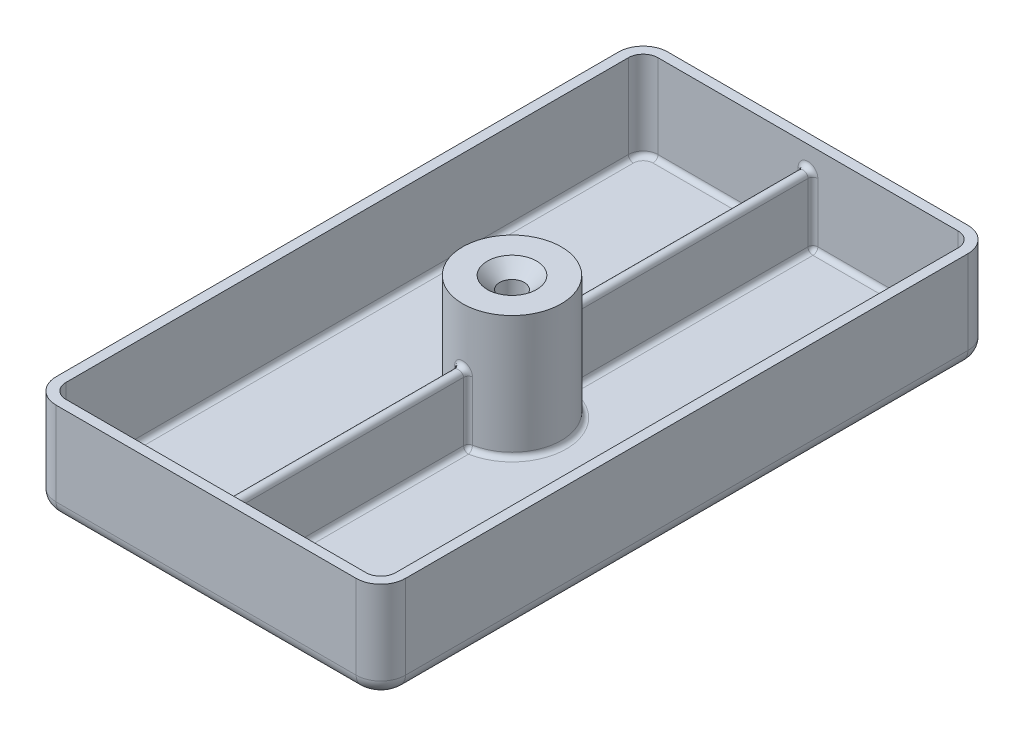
ISO-10303-21;
HEADER;
FILE_DESCRIPTION(('STEP AP214'),'2;1');
FILE_NAME('part.step','',(''),(''),'','','');
FILE_SCHEMA(('AUTOMOTIVE_DESIGN { 1 0 10303 214 1 1 1 1 }'));
ENDSEC;
DATA;
#1=APPLICATION_CONTEXT('core data for automotive mechanical design processes');
#2=APPLICATION_PROTOCOL_DEFINITION('international standard','automotive_design',2000,#1);
#3=PRODUCT_CONTEXT('',#1,'mechanical');
#4=PRODUCT('Part','Part','',(#3));
#5=PRODUCT_RELATED_PRODUCT_CATEGORY('part','',(#4));
#6=PRODUCT_DEFINITION_FORMATION('','',#4);
#7=PRODUCT_DEFINITION_CONTEXT('part definition',#1,'design');
#8=PRODUCT_DEFINITION('design','',#6,#7);
#9=PRODUCT_DEFINITION_SHAPE('','',#8);
#10=(LENGTH_UNIT() NAMED_UNIT(*) SI_UNIT(.MILLI.,.METRE.));
#11=(NAMED_UNIT(*) PLANE_ANGLE_UNIT() SI_UNIT($,.RADIAN.));
#12=(NAMED_UNIT(*) SI_UNIT($,.STERADIAN.) SOLID_ANGLE_UNIT());
#13=UNCERTAINTY_MEASURE_WITH_UNIT(LENGTH_MEASURE(1.E-05),#10,'distance_accuracy_value','');
#14=(GEOMETRIC_REPRESENTATION_CONTEXT(3) GLOBAL_UNCERTAINTY_ASSIGNED_CONTEXT((#13)) GLOBAL_UNIT_ASSIGNED_CONTEXT((#10,
#11,#12)) REPRESENTATION_CONTEXT('',''));
#15=CARTESIAN_POINT('',(0.,0.,0.));
#16=DIRECTION('',(0.,0.,1.));
#17=DIRECTION('',(1.,0.,0.));
#18=AXIS2_PLACEMENT_3D('',#15,#16,#17);
#19=CARTESIAN_POINT('',(-35.4102446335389,0.,62.0051824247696));
#20=DIRECTION('',(0.,-1.,0.));
#21=DIRECTION('',(0.,0.,-1.));
#22=AXIS2_PLACEMENT_3D('',#19,#20,#21);
#23=PLANE('',#22);
#24=DIRECTION('',(1.,0.,0.));
#25=VECTOR('',#24,1.);
#26=CARTESIAN_POINT('',(-30.4102446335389,0.,59.0051824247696));
#27=LINE('',#26,#25);
#28=CARTESIAN_POINT('',(30.4102446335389,0.,59.0051824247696));
#29=VERTEX_POINT('',#28);
#30=CARTESIAN_POINT('',(-30.4102446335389,0.,59.0051824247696));
#31=VERTEX_POINT('',#30);
#32=EDGE_CURVE('E482',#29,#31,#27,.F.);
#33=ORIENTED_EDGE('',*,*,#32,.T.);
#34=CARTESIAN_POINT('',(-30.4102446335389,0.,57.0051824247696));
#35=DIRECTION('',(0.,-1.,0.));
#36=DIRECTION('',(0.,0.,-1.));
#37=AXIS2_PLACEMENT_3D('',#34,#35,#36);
#38=CIRCLE('',#37,2.);
#39=CARTESIAN_POINT('',(-32.4102446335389,0.,57.0051824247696));
#40=VERTEX_POINT('',#39);
#41=EDGE_CURVE('E478',#31,#40,#38,.T.);
#42=ORIENTED_EDGE('',*,*,#41,.T.);
#43=DIRECTION('',(0.,0.,-1.));
#44=VECTOR('',#43,1.);
#45=CARTESIAN_POINT('',(-32.4102446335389,0.,62.0051824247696));
#46=LINE('',#45,#44);
#47=CARTESIAN_POINT('',(-32.4102446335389,0.,-57.0051824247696));
#48=VERTEX_POINT('',#47);
#49=EDGE_CURVE('E474',#40,#48,#46,.T.);
#50=ORIENTED_EDGE('',*,*,#49,.T.);
#51=CARTESIAN_POINT('',(-30.4102446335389,0.,-57.0051824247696));
#52=DIRECTION('',(0.,-1.,0.));
#53=DIRECTION('',(0.,0.,-1.));
#54=AXIS2_PLACEMENT_3D('',#51,#52,#53);
#55=CIRCLE('',#54,2.);
#56=CARTESIAN_POINT('',(-30.4102446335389,0.,-59.0051824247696));
#57=VERTEX_POINT('',#56);
#58=EDGE_CURVE('E476',#48,#57,#55,.T.);
#59=ORIENTED_EDGE('',*,*,#58,.T.);
#60=DIRECTION('',(-1.,0.,0.));
#61=VECTOR('',#60,1.);
#62=CARTESIAN_POINT('',(30.4102446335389,0.,-59.0051824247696));
#63=LINE('',#62,#61);
#64=CARTESIAN_POINT('',(30.4102446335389,0.,-59.0051824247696));
#65=VERTEX_POINT('',#64);
#66=EDGE_CURVE('E480',#57,#65,#63,.F.);
#67=ORIENTED_EDGE('',*,*,#66,.T.);
#68=CARTESIAN_POINT('',(30.4102446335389,0.,-57.0051824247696));
#69=DIRECTION('',(0.,-1.,0.));
#70=DIRECTION('',(0.,0.,-1.));
#71=AXIS2_PLACEMENT_3D('',#68,#69,#70);
#72=CIRCLE('',#71,2.);
#73=CARTESIAN_POINT('',(32.4102446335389,0.,-57.0051824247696));
#74=VERTEX_POINT('',#73);
#75=EDGE_CURVE('E484',#65,#74,#72,.T.);
#76=ORIENTED_EDGE('',*,*,#75,.T.);
#77=DIRECTION('',(0.,0.,1.));
#78=VECTOR('',#77,1.);
#79=CARTESIAN_POINT('',(32.4102446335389,0.,62.0051824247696));
#80=LINE('',#79,#78);
#81=CARTESIAN_POINT('',(32.4102446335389,0.,57.0051824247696));
#82=VERTEX_POINT('',#81);
#83=EDGE_CURVE('E488',#74,#82,#80,.T.);
#84=ORIENTED_EDGE('',*,*,#83,.T.);
#85=CARTESIAN_POINT('',(30.4102446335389,0.,57.0051824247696));
#86=DIRECTION('',(0.,-1.,0.));
#87=DIRECTION('',(0.,0.,-1.));
#88=AXIS2_PLACEMENT_3D('',#85,#86,#87);
#89=CIRCLE('',#88,2.);
#90=EDGE_CURVE('E486',#82,#29,#89,.T.);
#91=ORIENTED_EDGE('',*,*,#90,.T.);
#92=EDGE_LOOP('',(#33,#42,#50,#59,#67,#76,#84,#91));
#93=FACE_BOUND('',#92,.T.);
#94=CARTESIAN_POINT('',(0.,0.,0.));
#95=DIRECTION('',(0.,1.,0.));
#96=DIRECTION('',(0.,0.,1.));
#97=AXIS2_PLACEMENT_3D('',#94,#95,#96);
#98=CIRCLE('',#97,2.49999999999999);
#99=CARTESIAN_POINT('',(0.,0.,2.49999999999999));
#100=VERTEX_POINT('',#99);
#101=EDGE_CURVE('E662',#100,#100,#98,.T.);
#102=ORIENTED_EDGE('',*,*,#101,.T.);
#103=EDGE_LOOP('',(#102));
#104=FACE_BOUND('',#103,.T.);
#105=ADVANCED_FACE('F28',(#93,#104),#23,.T.);
#106=CARTESIAN_POINT('',(0.,27.,0.));
#107=DIRECTION('',(0.,1.,0.));
#108=DIRECTION('',(0.,0.,1.));
#109=AXIS2_PLACEMENT_3D('',#106,#107,#108);
#110=PLANE('',#109);
#111=CARTESIAN_POINT('',(0.,27.,0.));
#112=DIRECTION('',(0.,1.,0.));
#113=DIRECTION('',(0.,0.,1.));
#114=AXIS2_PLACEMENT_3D('',#111,#112,#113);
#115=CIRCLE('',#114,10.);
#116=CARTESIAN_POINT('',(0.,27.,10.));
#117=VERTEX_POINT('',#116);
#118=EDGE_CURVE('E390',#117,#117,#115,.T.);
#119=ORIENTED_EDGE('',*,*,#118,.T.);
#120=EDGE_LOOP('',(#119));
#121=FACE_BOUND('',#120,.T.);
#122=CARTESIAN_POINT('',(0.,27.,0.));
#123=DIRECTION('',(0.,1.,0.));
#124=DIRECTION('',(0.,0.,1.));
#125=AXIS2_PLACEMENT_3D('',#122,#123,#124);
#126=CIRCLE('',#125,4.99999999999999);
#127=CARTESIAN_POINT('',(0.,27.,4.99999999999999));
#128=VERTEX_POINT('',#127);
#129=EDGE_CURVE('E657',#128,#128,#126,.T.);
#130=ORIENTED_EDGE('',*,*,#129,.F.);
#131=EDGE_LOOP('',(#130));
#132=FACE_BOUND('',#131,.T.);
#133=ADVANCED_FACE('F640',(#121,#132),#110,.T.);
#134=CARTESIAN_POINT('',(0.,15.,-60.0051824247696));
#135=DIRECTION('',(0.,0.,-1.));
#136=DIRECTION('',(-1.,0.,0.));
#137=AXIS2_PLACEMENT_3D('',#134,#135,#136);
#138=CYLINDRICAL_SURFACE('',#137,1.);
#139=DIRECTION('',(0.,0.,-1.));
#140=VECTOR('',#139,1.);
#141=CARTESIAN_POINT('',(-1.,15.,33.533391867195));
#142=LINE('',#141,#140);
#143=CARTESIAN_POINT('',(-1.,15.,59.0051824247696));
#144=VERTEX_POINT('',#143);
#145=CARTESIAN_POINT('',(-1.,15.,10.816653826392));
#146=VERTEX_POINT('',#145);
#147=EDGE_CURVE('E511',#144,#146,#142,.T.);
#148=ORIENTED_EDGE('',*,*,#147,.F.);
#149=CARTESIAN_POINT('',(0.,15.,59.0051824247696));
#150=DIRECTION('',(0.,0.,-1.));
#151=DIRECTION('',(-1.,0.,0.));
#152=AXIS2_PLACEMENT_3D('',#149,#150,#151);
#153=CIRCLE('',#152,1.);
#154=CARTESIAN_POINT('',(1.,15.,59.0051824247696));
#155=VERTEX_POINT('',#154);
#156=EDGE_CURVE('E789',#144,#155,#153,.T.);
#157=ORIENTED_EDGE('',*,*,#156,.T.);
#158=DIRECTION('',(0.,0.,1.));
#159=VECTOR('',#158,1.);
#160=CARTESIAN_POINT('',(1.,15.,-60.0051824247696));
#161=LINE('',#160,#159);
#162=CARTESIAN_POINT('',(1.,15.,10.816653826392));
#163=VERTEX_POINT('',#162);
#164=EDGE_CURVE('E508',#163,#155,#161,.T.);
#165=ORIENTED_EDGE('',*,*,#164,.F.);
#166=CARTESIAN_POINT('',(0.94471526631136,14.6721081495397,10.8365147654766));
#167=CARTESIAN_POINT('',(0.928826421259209,14.6263295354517,9.98891704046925));
#168=CARTESIAN_POINT('',(1.71766412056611,14.3442162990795,9.85137705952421));
#169=CARTESIAN_POINT('',(0.953840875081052,14.6984010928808,10.8333306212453));
#170=CARTESIAN_POINT('',(0.940378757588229,14.6554868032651,9.98826993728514));
#171=CARTESIAN_POINT('',(1.73425613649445,14.3968021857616,9.84848238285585));
#172=CARTESIAN_POINT('',(0.961867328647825,14.7250722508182,10.8304863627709));
#173=CARTESIAN_POINT('',(0.950641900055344,14.6854040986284,9.98767025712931));
#174=CARTESIAN_POINT('',(1.74884968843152,14.4501445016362,9.84589669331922));
#175=CARTESIAN_POINT('',(0.975672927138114,14.779006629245,10.8255463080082));
#176=CARTESIAN_POINT('',(0.968377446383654,14.7463231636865,9.98660687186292));
#177=CARTESIAN_POINT('',(1.77395077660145,14.55801325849,9.84140573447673));
#178=CARTESIAN_POINT('',(0.981452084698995,14.8062698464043,10.823450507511));
#179=CARTESIAN_POINT('',(0.975861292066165,14.7773420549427,9.9861425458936));
#180=CARTESIAN_POINT('',(1.78445833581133,14.6125396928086,9.83950046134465));
#181=CARTESIAN_POINT('',(0.995328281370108,14.888600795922,10.8183949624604));
#182=CARTESIAN_POINT('',(0.9938463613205,14.8713796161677,9.98501291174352));
#183=CARTESIAN_POINT('',(1.80968778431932,14.7772015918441,9.83490451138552));
#184=CARTESIAN_POINT('',(0.999997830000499,14.9443073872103,10.816654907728));
#185=CARTESIAN_POINT('',(0.99999641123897,14.9357433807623,9.98460387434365));
#186=CARTESIAN_POINT('',(1.81817787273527,14.8886147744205,9.83332264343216));
#187=CARTESIAN_POINT('',(1.00000217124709,15.055724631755,10.8166527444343));
#188=CARTESIAN_POINT('',(1.00000359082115,15.0642935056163,9.98460318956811));
#189=CARTESIAN_POINT('',(1.8181857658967,15.11144926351,9.83332067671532));
#190=CARTESIAN_POINT('',(0.995331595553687,15.1114352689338,10.8183926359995));
#191=CARTESIAN_POINT('',(0.993853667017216,15.1286658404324,9.98501201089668));
#192=CARTESIAN_POINT('',(1.80969381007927,15.2228705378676,9.8349023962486));
#193=CARTESIAN_POINT('',(0.976804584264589,15.2212490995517,10.8251448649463));
#194=CARTESIAN_POINT('',(0.969817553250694,15.2541744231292,9.98652259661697));
#195=CARTESIAN_POINT('',(1.77600833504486,15.4424981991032,9.84104078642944));
#196=CARTESIAN_POINT('',(0.962950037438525,15.2753526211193,10.8301565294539));
#197=CARTESIAN_POINT('',(0.951867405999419,15.3154752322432,9.98762826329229));
#198=CARTESIAN_POINT('',(1.75081824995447,15.5507052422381,9.84559684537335));
#199=CARTESIAN_POINT('',(0.926488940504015,15.3804067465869,10.8428700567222));
#200=CARTESIAN_POINT('',(0.905671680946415,15.43215301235,9.99021218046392));
#201=CARTESIAN_POINT('',(1.68452534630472,15.7608134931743,9.85715459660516));
#202=CARTESIAN_POINT('',(0.903886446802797,15.4313587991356,10.8505706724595));
#203=CARTESIAN_POINT('',(0.877320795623,15.4876378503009,9.99169531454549));
#204=CARTESIAN_POINT('',(1.64342990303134,15.862717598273,9.86415515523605));
#205=CARTESIAN_POINT('',(0.850588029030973,15.5287554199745,10.8677920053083));
#206=CARTESIAN_POINT('',(0.8124210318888,15.5907083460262,9.99462579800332));
#207=CARTESIAN_POINT('',(1.54652368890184,16.0575108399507,9.87981091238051));
#208=CARTESIAN_POINT('',(0.819891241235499,15.5751995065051,10.8773129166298));
#209=CARTESIAN_POINT('',(0.775754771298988,15.6383209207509,9.99607535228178));
#210=CARTESIAN_POINT('',(1.49071134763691,16.1503990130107,9.8884662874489));
#211=CARTESIAN_POINT('',(0.750895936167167,15.6627940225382,10.8972252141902));
#212=CARTESIAN_POINT('',(0.696286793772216,15.7248996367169,9.99859025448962));
#213=CARTESIAN_POINT('',(1.36526533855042,16.3255880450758,9.90656837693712));
#214=CARTESIAN_POINT('',(0.71252139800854,15.7038841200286,10.9076246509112));
#215=CARTESIAN_POINT('',(0.653342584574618,15.7637201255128,9.99964876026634));
#216=CARTESIAN_POINT('',(1.2954934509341,16.4077682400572,9.91602240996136));
#217=CARTESIAN_POINT('',(0.629428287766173,15.7790761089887,10.9280499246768));
#218=CARTESIAN_POINT('',(0.564194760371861,15.831763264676,10.0011661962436));
#219=CARTESIAN_POINT('',(1.14441506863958,16.5581522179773,9.93459084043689));
#220=CARTESIAN_POINT('',(0.584709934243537,15.8131782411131,10.9380757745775));
#221=CARTESIAN_POINT('',(0.517968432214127,15.8608893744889,10.0016193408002));
#222=CARTESIAN_POINT('',(1.06310897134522,16.6263564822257,9.94370524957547));
#223=CARTESIAN_POINT('',(0.489797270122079,15.8736633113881,10.956712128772));
#224=CARTESIAN_POINT('',(0.424080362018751,15.910281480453,10.0019848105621));
#225=CARTESIAN_POINT('',(0.89054049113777,16.7473266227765,9.96064738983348));
#226=CARTESIAN_POINT('',(0.43956592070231,15.8999890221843,10.9653119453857));
#227=CARTESIAN_POINT('',(0.376464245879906,15.9303674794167,10.0018880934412));
#228=CARTESIAN_POINT('',(0.799210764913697,16.7999780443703,9.96846540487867));
#229=CARTESIAN_POINT('',(0.335301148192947,15.9438062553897,10.9800366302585));
#230=CARTESIAN_POINT('',(0.281507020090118,15.9625263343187,10.0014285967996));
#231=CARTESIAN_POINT('',(0.609638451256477,16.8876125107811,9.98185148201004));
#232=CARTESIAN_POINT('',(0.281267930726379,15.96129825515,10.9861616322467));
#233=CARTESIAN_POINT('',(0.234278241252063,15.9745045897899,10.0010644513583));
#234=CARTESIAN_POINT('',(0.511396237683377,16.9225965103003,9.9874196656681));
#235=CARTESIAN_POINT('',(0.17156230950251,15.9867636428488,10.9951891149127));
#236=CARTESIAN_POINT('',(0.140952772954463,15.9915850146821,10.0004338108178));
#237=CARTESIAN_POINT('',(0.311931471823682,16.9735272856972,9.99562646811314));
#238=CARTESIAN_POINT('',(0.115914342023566,15.9948391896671,10.9981261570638));
#239=CARTESIAN_POINT('',(0.0949921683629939,15.9967056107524,10.0001676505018));
#240=CARTESIAN_POINT('',(0.210753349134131,16.9896783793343,9.9982965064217));
#241=CARTESIAN_POINT('',(0.00403551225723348,16.0015605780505,11.0005658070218));
#242=CARTESIAN_POINT('',(0.00318532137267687,16.0010015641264,9.99995015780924));
#243=CARTESIAN_POINT('',(0.00733729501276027,17.0031211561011,10.0005143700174));
#244=CARTESIAN_POINT('',(-0.052195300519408,16.0002072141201,11.0000687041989));
#245=CARTESIAN_POINT('',(-0.04250312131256,16.0001627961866,9.9999995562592));
#246=CARTESIAN_POINT('',(-0.0949005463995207,17.00041442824,10.0000624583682));
#247=CARTESIAN_POINT('',(-0.162944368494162,15.9881879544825,10.9957231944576));
#248=CARTESIAN_POINT('',(-0.133954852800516,15.9924152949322,10.000372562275));
#249=CARTESIAN_POINT('',(-0.296262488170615,16.9763759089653,9.99611199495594));
#250=CARTESIAN_POINT('',(-0.217474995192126,15.9776319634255,10.9919143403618));
#251=CARTESIAN_POINT('',(-0.17955862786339,15.9856038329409,10.0006917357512));
#252=CARTESIAN_POINT('',(-0.395409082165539,16.9552639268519,9.99264940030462));
#253=CARTESIAN_POINT('',(-0.323978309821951,15.9476805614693,10.9814175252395));
#254=CARTESIAN_POINT('',(-0.271625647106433,15.9650810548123,10.0013324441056));
#255=CARTESIAN_POINT('',(-0.589051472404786,16.8953611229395,9.9831068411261));
#256=CARTESIAN_POINT('',(-0.375950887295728,15.9282847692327,10.9747294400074));
#257=CARTESIAN_POINT('',(-0.317956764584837,15.951433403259,10.0016530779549));
#258=CARTESIAN_POINT('',(-0.683547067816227,16.8565695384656,9.97702676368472));
#259=CARTESIAN_POINT('',(-0.476184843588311,15.8810976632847,10.9591589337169));
#260=CARTESIAN_POINT('',(-0.411072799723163,15.9158950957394,10.0019553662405));
#261=CARTESIAN_POINT('',(-0.865790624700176,16.7621953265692,9.9628717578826));
#262=CARTESIAN_POINT('',(-0.524424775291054,15.8532617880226,10.9502649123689));
#263=CARTESIAN_POINT('',(-0.457766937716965,15.8940564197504,10.0019374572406));
#264=CARTESIAN_POINT('',(-0.953499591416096,16.7065235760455,9.95478628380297));
#265=CARTESIAN_POINT('',(-0.61558677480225,15.7900195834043,10.9312682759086));
#266=CARTESIAN_POINT('',(-0.549709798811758,15.8411213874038,10.0013251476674));
#267=CARTESIAN_POINT('',(-1.11924868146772,16.580039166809,9.93751661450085));
#268=CARTESIAN_POINT('',(-0.65850869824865,15.754613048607,10.9211656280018));
#269=CARTESIAN_POINT('',(-0.594926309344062,15.810132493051,10.0007361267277));
#270=CARTESIAN_POINT('',(-1.19728854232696,16.5092260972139,9.92833238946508));
#271=CARTESIAN_POINT('',(-0.738473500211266,15.6766246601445,10.9006987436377));
#272=CARTESIAN_POINT('',(-0.682173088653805,15.7380576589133,9.99896996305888));
#273=CARTESIAN_POINT('',(-1.3426790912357,16.3532493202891,9.90972613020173));
#274=CARTESIAN_POINT('',(-0.775422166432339,15.6339462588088,10.8903328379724));
#275=CARTESIAN_POINT('',(-0.724192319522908,15.6969160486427,9.99778972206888));
#276=CARTESIAN_POINT('',(-1.40985848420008,16.2678925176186,9.90030257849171));
#277=CARTESIAN_POINT('',(-0.841648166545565,15.5429494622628,10.8706490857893));
#278=CARTESIAN_POINT('',(-0.801548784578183,15.6054029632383,9.99509053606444));
#279=CARTESIAN_POINT('',(-1.53026939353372,16.0858989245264,9.88240825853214));
#280=CARTESIAN_POINT('',(-0.870925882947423,15.4946313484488,10.8613311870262));
#281=CARTESIAN_POINT('',(-0.836984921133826,15.555063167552,9.99357310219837));
#282=CARTESIAN_POINT('',(-1.58350160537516,15.9892626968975,9.87393744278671));
#283=CARTESIAN_POINT('',(-0.921029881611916,15.3935660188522,10.8447872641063));
#284=CARTESIAN_POINT('',(-0.898678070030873,15.446648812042,9.99060694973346));
#285=CARTESIAN_POINT('',(-1.67459978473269,15.7871320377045,9.85889751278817));
#286=CARTESIAN_POINT('',(-0.941835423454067,15.3408083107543,10.8375663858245));
#287=CARTESIAN_POINT('',(-0.925037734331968,15.3885053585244,9.98915503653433));
#288=CARTESIAN_POINT('',(-1.71242804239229,15.6816166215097,9.85233307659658));
#289=CARTESIAN_POINT('',(-0.974221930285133,15.2325364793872,10.826110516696));
#290=CARTESIAN_POINT('',(-0.966384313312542,15.2671274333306,9.98675203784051));
#291=CARTESIAN_POINT('',(-1.7713126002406,15.4650729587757,9.84191864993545));
#292=CARTESIAN_POINT('',(-0.985820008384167,15.1770276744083,10.8218699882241));
#293=CARTESIAN_POINT('',(-0.981498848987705,15.2037745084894,9.9857946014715));
#294=CARTESIAN_POINT('',(-1.79240001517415,15.3540553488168,9.83806362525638));
#295=CARTESIAN_POINT('',(-0.997549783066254,15.0808414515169,10.8175619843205));
#296=CARTESIAN_POINT('',(-0.996788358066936,15.0933145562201,9.98481444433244));
#297=CARTESIAN_POINT('',(-1.81372687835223,15.1616829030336,9.83414725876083));
#298=CARTESIAN_POINT('',(-1.00000426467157,15.0404351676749,10.8166507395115));
#299=CARTESIAN_POINT('',(-1.00000998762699,15.046654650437,9.98460204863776));
#300=CARTESIAN_POINT('',(-1.81818957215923,15.0808703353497,9.83331885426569));
#301=CARTESIAN_POINT('',(-0.999994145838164,14.9444941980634,10.8166580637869));
#302=CARTESIAN_POINT('',(-0.99998628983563,14.9359564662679,9.98460556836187));
#303=CARTESIAN_POINT('',(-1.81817117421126,14.8889883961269,9.833325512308));
#304=CARTESIAN_POINT('',(-0.995355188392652,14.8889339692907,10.8183852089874));
#305=CARTESIAN_POINT('',(-0.993881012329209,14.871764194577,9.98501076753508));
#306=CARTESIAN_POINT('',(-1.80973670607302,14.7778679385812,9.83489564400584));
#307=CARTESIAN_POINT('',(-0.981533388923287,14.806665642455,10.8234208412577));
#308=CARTESIAN_POINT('',(-0.975967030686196,14.7777928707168,9.98613587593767));
#309=CARTESIAN_POINT('',(-1.78460616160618,14.6133312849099,9.83947349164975));
#310=CARTESIAN_POINT('',(-0.975746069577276,14.7793170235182,10.8255198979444));
#311=CARTESIAN_POINT('',(-0.968471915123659,14.746674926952,9.98660107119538));
#312=CARTESIAN_POINT('',(-1.77408376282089,14.5586340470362,9.84138172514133));
#313=CARTESIAN_POINT('',(-0.961912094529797,14.7252227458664,10.8304705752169));
#314=CARTESIAN_POINT('',(-0.950698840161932,14.6855725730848,9.98766697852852));
#315=CARTESIAN_POINT('',(-1.74893108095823,14.4504454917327,9.84588234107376));
#316=CARTESIAN_POINT('',(-0.953866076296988,14.6984769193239,10.8333219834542));
#317=CARTESIAN_POINT('',(-0.94041014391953,14.6555705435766,9.98826827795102));
#318=CARTESIAN_POINT('',(-1.73430195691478,14.3969538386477,9.84847453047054));
#319=CARTESIAN_POINT('',(-0.944715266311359,14.6721081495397,10.8365147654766));
#320=CARTESIAN_POINT('',(-0.928826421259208,14.6263295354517,9.98891704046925));
#321=CARTESIAN_POINT('',(-1.71766412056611,14.3442162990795,9.85137705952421));
#322=(BOUNDED_SURFACE() B_SPLINE_SURFACE(3,2,((#166,#167,#168),(#169,#170,#171),(#172,#173,
#174),(#175,#176,#177),(#178,#179,#180),(#181,#182,#183),(#184,#185,#186),(#187,#188,#189),
(#190,#191,#192),(#193,#194,#195),(#196,#197,#198),(#199,#200,#201),(#202,#203,#204),(#205,#206,
#207),(#208,#209,#210),(#211,#212,#213),(#214,#215,#216),(#217,#218,#219),(#220,#221,#222),
(#223,#224,#225),(#226,#227,#228),(#229,#230,#231),(#232,#233,#234),(#235,#236,#237),(#238,#239,
#240),(#241,#242,#243),(#244,#245,#246),(#247,#248,#249),(#250,#251,#252),(#253,#254,#255),
(#256,#257,#258),(#259,#260,#261),(#262,#263,#264),(#265,#266,#267),(#268,#269,#270),(#271,#272,
#273),(#274,#275,#276),(#277,#278,#279),(#280,#281,#282),(#283,#284,#285),(#286,#287,#288),
(#289,#290,#291),(#292,#293,#294),(#295,#296,#297),(#298,#299,#300),(#301,#302,#303),(#304,#305,
#306),(#307,#308,#309),(#310,#311,#312),(#313,#314,#315),(#316,#317,#318),(#319,#320,#321)),
.UNSPECIFIED.,.F.,.F.,.F.) B_SPLINE_SURFACE_WITH_KNOTS((4,2,2,2,2,2,2,2,2,2,2,2,2,2,2,2,2,2,2,2,
2,2,2,2,2,4),(3,3),(0.,0.16716119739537,0.334321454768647,0.668029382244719,1.00192916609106,
1.33576030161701,1.66943682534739,2.00314896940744,2.34034528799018,2.67752999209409,
3.0171375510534,3.35672675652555,3.69259644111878,4.0284378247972,4.36032244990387,
4.69222139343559,5.02590413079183,5.35959592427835,5.698123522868,6.03663423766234,
6.3759687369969,6.71467105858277,6.95705773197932,7.28978459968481,7.45746081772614,
7.6250897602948),(0.,1.),
.UNSPECIFIED.) GEOMETRIC_REPRESENTATION_ITEM() RATIONAL_B_SPLINE_SURFACE(((1.,0.762322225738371,
1.),(1.,0.76335088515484,1.),(1.,0.764267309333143,1.),(1.,0.765856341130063,1.),(1.,
0.76652895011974,1.),(1.,0.768150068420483,1.),(1.,0.768705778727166,1.),(1.,0.768706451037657,
1.),(1.,0.76815077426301,1.),(1.,0.765985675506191,1.),(1.,0.764376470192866,1.),(1.,
0.760268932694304,1.),(1.,0.757771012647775,1.),(1.,0.752141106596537,1.),(1.,0.749009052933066,
1.),(1.,0.74240188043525,1.),(1.,0.738923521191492,1.),(1.,0.732032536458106,1.),(1.,
0.728619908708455,1.),(1.,0.722228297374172,1.),(1.,0.719252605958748,1.),(1.,0.714129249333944,
1.),(1.,0.711981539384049,1.),(1.,0.708807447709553,1.),(1.,0.707769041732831,1.),(1.,
0.706906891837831,1.),(1.,0.707083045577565,1.),(1.,0.708617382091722,1.),(1.,0.709961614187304,
1.),(1.,0.713643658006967,1.),(1.,0.715981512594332,1.),(1.,0.721381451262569,1.),(1.,
0.724447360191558,1.),(1.,0.730938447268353,1.),(1.,0.734363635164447,1.),(1.,0.741242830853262,
1.),(1.,0.744696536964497,1.),(1.,0.751204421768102,1.),(1.,0.754258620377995,1.),(1.,
0.759649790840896,1.),(1.,0.761984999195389,1.),(1.,0.765677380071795,1.),(1.,0.767036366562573,
1.),(1.,0.768415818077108,1.),(1.,0.768707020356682,1.),(1.,0.768704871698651,1.),(1.,
0.768153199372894,1.),(1.,0.766538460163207,1.),(1.,0.765864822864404,1.),(1.,0.764272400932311,
1.),(1.,0.763353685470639,1.),(1.,0.762322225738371,1.))) REPRESENTATION_ITEM('') SURFACE());
#323=CARTESIAN_POINT('',(0.94471526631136,14.6721081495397,10.8365147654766));
#324=CARTESIAN_POINT('',(0.953840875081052,14.6984010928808,10.8333306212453));
#325=CARTESIAN_POINT('',(0.961867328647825,14.7250722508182,10.8304863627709));
#326=CARTESIAN_POINT('',(0.975672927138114,14.779006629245,10.8255463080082));
#327=CARTESIAN_POINT('',(0.981452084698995,14.8062698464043,10.823450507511));
#328=CARTESIAN_POINT('',(0.995328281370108,14.888600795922,10.8183949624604));
#329=CARTESIAN_POINT('',(0.999997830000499,14.9443073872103,10.816654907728));
#330=CARTESIAN_POINT('',(1.00000217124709,15.055724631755,10.8166527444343));
#331=CARTESIAN_POINT('',(0.995331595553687,15.1114352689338,10.8183926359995));
#332=CARTESIAN_POINT('',(0.976804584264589,15.2212490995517,10.8251448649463));
#333=CARTESIAN_POINT('',(0.962950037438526,15.2753526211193,10.8301565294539));
#334=CARTESIAN_POINT('',(0.926488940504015,15.3804067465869,10.8428700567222));
#335=CARTESIAN_POINT('',(0.903886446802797,15.4313587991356,10.8505706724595));
#336=CARTESIAN_POINT('',(0.850588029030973,15.5287554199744,10.8677920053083));
#337=CARTESIAN_POINT('',(0.819891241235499,15.5751995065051,10.8773129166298));
#338=CARTESIAN_POINT('',(0.750895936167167,15.6627940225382,10.8972252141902));
#339=CARTESIAN_POINT('',(0.71252139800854,15.7038841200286,10.9076246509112));
#340=CARTESIAN_POINT('',(0.629428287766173,15.7790761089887,10.9280499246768));
#341=CARTESIAN_POINT('',(0.584709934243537,15.8131782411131,10.9380757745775));
#342=CARTESIAN_POINT('',(0.489797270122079,15.8736633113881,10.956712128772));
#343=CARTESIAN_POINT('',(0.43956592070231,15.8999890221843,10.9653119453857));
#344=CARTESIAN_POINT('',(0.335301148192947,15.9438062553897,10.9800366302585));
#345=CARTESIAN_POINT('',(0.281267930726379,15.96129825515,10.9861616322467));
#346=CARTESIAN_POINT('',(0.17156230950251,15.9867636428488,10.9951891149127));
#347=CARTESIAN_POINT('',(0.115914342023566,15.9948391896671,10.9981261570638));
#348=CARTESIAN_POINT('',(0.00403551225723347,16.0015605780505,11.0005658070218));
#349=CARTESIAN_POINT('',(-0.0521953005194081,16.0002072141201,11.0000687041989));
#350=CARTESIAN_POINT('',(-0.162944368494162,15.9881879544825,10.9957231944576));
#351=CARTESIAN_POINT('',(-0.217474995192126,15.9776319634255,10.9919143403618));
#352=CARTESIAN_POINT('',(-0.323978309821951,15.9476805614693,10.9814175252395));
#353=CARTESIAN_POINT('',(-0.375950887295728,15.9282847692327,10.9747294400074));
#354=CARTESIAN_POINT('',(-0.476184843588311,15.8810976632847,10.9591589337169));
#355=CARTESIAN_POINT('',(-0.524424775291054,15.8532617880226,10.9502649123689));
#356=CARTESIAN_POINT('',(-0.61558677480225,15.7900195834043,10.9312682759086));
#357=CARTESIAN_POINT('',(-0.65850869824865,15.754613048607,10.9211656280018));
#358=CARTESIAN_POINT('',(-0.738473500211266,15.6766246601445,10.9006987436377));
#359=CARTESIAN_POINT('',(-0.775422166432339,15.6339462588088,10.8903328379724));
#360=CARTESIAN_POINT('',(-0.841648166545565,15.5429494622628,10.8706490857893));
#361=CARTESIAN_POINT('',(-0.870925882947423,15.4946313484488,10.8613311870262));
#362=CARTESIAN_POINT('',(-0.921029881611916,15.3935660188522,10.8447872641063));
#363=CARTESIAN_POINT('',(-0.941835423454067,15.3408083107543,10.8375663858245));
#364=CARTESIAN_POINT('',(-0.974221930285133,15.2325364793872,10.826110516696));
#365=CARTESIAN_POINT('',(-0.985820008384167,15.1770276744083,10.8218699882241));
#366=CARTESIAN_POINT('',(-0.997549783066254,15.0808414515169,10.8175619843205));
#367=CARTESIAN_POINT('',(-1.00000426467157,15.0404351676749,10.8166507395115));
#368=CARTESIAN_POINT('',(-0.999994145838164,14.9444941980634,10.8166580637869));
#369=CARTESIAN_POINT('',(-0.995355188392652,14.8889339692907,10.8183852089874));
#370=CARTESIAN_POINT('',(-0.981533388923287,14.806665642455,10.8234208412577));
#371=CARTESIAN_POINT('',(-0.975746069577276,14.7793170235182,10.8255198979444));
#372=CARTESIAN_POINT('',(-0.961912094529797,14.7252227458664,10.8304705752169));
#373=CARTESIAN_POINT('',(-0.953866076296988,14.6984769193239,10.8333219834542));
#374=CARTESIAN_POINT('',(-0.944715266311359,14.6721081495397,10.8365147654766));
#375=B_SPLINE_CURVE_WITH_KNOTS('',3,(#323,#324,#325,#326,#327,#328,#329,#330,#331,#332,#333,
#334,#335,#336,#337,#338,#339,#340,#341,#342,#343,#344,#345,#346,#347,#348,#349,#350,#351,#352,
#353,#354,#355,#356,#357,#358,#359,#360,#361,#362,#363,#364,#365,#366,#367,#368,#369,#370,#371,
#372,#373,#374),.UNSPECIFIED.,.F.,.F.,(4,2,2,2,2,2,2,2,2,2,2,2,2,2,2,2,2,2,2,2,2,2,2,2,2,4),(0.,
0.16716119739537,0.334321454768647,0.668029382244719,1.00192916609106,1.33576030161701,
1.66943682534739,2.00314896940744,2.34034528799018,2.67752999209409,3.0171375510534,
3.35672675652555,3.69259644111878,4.0284378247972,4.36032244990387,4.69222139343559,
5.02590413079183,5.35959592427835,5.698123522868,6.03663423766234,6.3759687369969,
6.71467105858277,6.95705773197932,7.28978459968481,7.45746081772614,7.6250897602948),.UNSPECIFIED.);
#376=EDGE_CURVE('E787',#163,#146,#375,.T.);
#377=ORIENTED_EDGE('',*,*,#376,.T.);
#378=EDGE_LOOP('',(#148,#157,#165,#377));
#379=FACE_BOUND('',#378,.T.);
#380=ADVANCED_FACE('F572',(#379),#138,.T.);
#381=CARTESIAN_POINT('',(1.,15.,-59.0051824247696));
#382=VERTEX_POINT('',#381);
#383=CARTESIAN_POINT('',(1.,15.,-10.816653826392));
#384=VERTEX_POINT('',#383);
#385=EDGE_CURVE('E510',#382,#384,#161,.T.);
#386=ORIENTED_EDGE('',*,*,#385,.F.);
#387=CARTESIAN_POINT('',(0.,15.,-59.0051824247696));
#388=DIRECTION('',(0.,0.,1.));
#389=DIRECTION('',(1.,0.,0.));
#390=AXIS2_PLACEMENT_3D('',#387,#388,#389);
#391=CIRCLE('',#390,1.);
#392=CARTESIAN_POINT('',(-1.,15.,-59.0051824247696));
#393=VERTEX_POINT('',#392);
#394=EDGE_CURVE('E796',#382,#393,#391,.T.);
#395=ORIENTED_EDGE('',*,*,#394,.T.);
#396=CARTESIAN_POINT('',(-1.,15.,-10.816653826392));
#397=VERTEX_POINT('',#396);
#398=EDGE_CURVE('E515',#397,#393,#142,.T.);
#399=ORIENTED_EDGE('',*,*,#398,.F.);
#400=CARTESIAN_POINT('',(-0.944715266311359,14.6721081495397,-10.8365147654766));
#401=CARTESIAN_POINT('',(-0.928826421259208,14.6263295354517,-9.98891704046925));
#402=CARTESIAN_POINT('',(-1.71766412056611,14.3442162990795,-9.85137705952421));
#403=CARTESIAN_POINT('',(-0.953840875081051,14.6984010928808,-10.8333306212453));
#404=CARTESIAN_POINT('',(-0.940378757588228,14.6554868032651,-9.98826993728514));
#405=CARTESIAN_POINT('',(-1.73425613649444,14.3968021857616,-9.84848238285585));
#406=CARTESIAN_POINT('',(-0.961867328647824,14.7250722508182,-10.8304863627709));
#407=CARTESIAN_POINT('',(-0.950641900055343,14.6854040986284,-9.98767025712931));
#408=CARTESIAN_POINT('',(-1.74884968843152,14.4501445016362,-9.84589669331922));
#409=CARTESIAN_POINT('',(-0.975672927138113,14.779006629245,-10.8255463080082));
#410=CARTESIAN_POINT('',(-0.968377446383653,14.7463231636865,-9.98660687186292));
#411=CARTESIAN_POINT('',(-1.77395077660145,14.55801325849,-9.84140573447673));
#412=CARTESIAN_POINT('',(-0.981452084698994,14.8062698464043,-10.823450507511));
#413=CARTESIAN_POINT('',(-0.975861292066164,14.7773420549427,-9.9861425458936));
#414=CARTESIAN_POINT('',(-1.78445833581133,14.6125396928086,-9.83950046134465));
#415=CARTESIAN_POINT('',(-0.995328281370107,14.888600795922,-10.8183949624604));
#416=CARTESIAN_POINT('',(-0.9938463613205,14.8713796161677,-9.98501291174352));
#417=CARTESIAN_POINT('',(-1.80968778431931,14.7772015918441,-9.83490451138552));
#418=CARTESIAN_POINT('',(-0.999997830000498,14.9443073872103,-10.816654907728));
#419=CARTESIAN_POINT('',(-0.999996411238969,14.9357433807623,-9.98460387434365));
#420=CARTESIAN_POINT('',(-1.81817787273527,14.8886147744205,-9.83332264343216));
#421=CARTESIAN_POINT('',(-1.00000217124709,15.055724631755,-10.8166527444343));
#422=CARTESIAN_POINT('',(-1.00000359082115,15.0642935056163,-9.98460318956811));
#423=CARTESIAN_POINT('',(-1.8181857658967,15.11144926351,-9.83332067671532));
#424=CARTESIAN_POINT('',(-0.995331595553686,15.1114352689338,-10.8183926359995));
#425=CARTESIAN_POINT('',(-0.993853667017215,15.1286658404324,-9.98501201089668));
#426=CARTESIAN_POINT('',(-1.80969381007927,15.2228705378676,-9.8349023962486));
#427=CARTESIAN_POINT('',(-0.976804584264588,15.2212490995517,-10.8251448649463));
#428=CARTESIAN_POINT('',(-0.969817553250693,15.2541744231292,-9.98652259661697));
#429=CARTESIAN_POINT('',(-1.77600833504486,15.4424981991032,-9.84104078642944));
#430=CARTESIAN_POINT('',(-0.962950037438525,15.2753526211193,-10.8301565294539));
#431=CARTESIAN_POINT('',(-0.951867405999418,15.3154752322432,-9.98762826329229));
#432=CARTESIAN_POINT('',(-1.75081824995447,15.5507052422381,-9.84559684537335));
#433=CARTESIAN_POINT('',(-0.926488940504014,15.3804067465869,-10.8428700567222));
#434=CARTESIAN_POINT('',(-0.905671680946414,15.43215301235,-9.99021218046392));
#435=CARTESIAN_POINT('',(-1.68452534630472,15.7608134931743,-9.85715459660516));
#436=CARTESIAN_POINT('',(-0.903886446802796,15.4313587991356,-10.8505706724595));
#437=CARTESIAN_POINT('',(-0.877320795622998,15.4876378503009,-9.99169531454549));
#438=CARTESIAN_POINT('',(-1.64342990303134,15.862717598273,-9.86415515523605));
#439=CARTESIAN_POINT('',(-0.850588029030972,15.5287554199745,-10.8677920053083));
#440=CARTESIAN_POINT('',(-0.812421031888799,15.5907083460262,-9.99462579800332));
#441=CARTESIAN_POINT('',(-1.54652368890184,16.0575108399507,-9.87981091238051));
#442=CARTESIAN_POINT('',(-0.819891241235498,15.5751995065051,-10.8773129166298));
#443=CARTESIAN_POINT('',(-0.775754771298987,15.638320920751,-9.99607535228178));
#444=CARTESIAN_POINT('',(-1.49071134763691,16.1503990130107,-9.8884662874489));
#445=CARTESIAN_POINT('',(-0.750895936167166,15.6627940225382,-10.8972252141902));
#446=CARTESIAN_POINT('',(-0.696286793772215,15.7248996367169,-9.99859025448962));
#447=CARTESIAN_POINT('',(-1.36526533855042,16.3255880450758,-9.90656837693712));
#448=CARTESIAN_POINT('',(-0.712521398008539,15.7038841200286,-10.9076246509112));
#449=CARTESIAN_POINT('',(-0.653342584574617,15.7637201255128,-9.99964876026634));
#450=CARTESIAN_POINT('',(-1.2954934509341,16.4077682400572,-9.91602240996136));
#451=CARTESIAN_POINT('',(-0.629428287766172,15.7790761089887,-10.9280499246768));
#452=CARTESIAN_POINT('',(-0.56419476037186,15.831763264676,-10.0011661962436));
#453=CARTESIAN_POINT('',(-1.14441506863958,16.5581522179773,-9.9345908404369));
#454=CARTESIAN_POINT('',(-0.584709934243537,15.8131782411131,-10.9380757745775));
#455=CARTESIAN_POINT('',(-0.517968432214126,15.8608893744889,-10.0016193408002));
#456=CARTESIAN_POINT('',(-1.06310897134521,16.6263564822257,-9.94370524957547));
#457=CARTESIAN_POINT('',(-0.489797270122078,15.8736633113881,-10.956712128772));
#458=CARTESIAN_POINT('',(-0.42408036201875,15.910281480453,-10.0019848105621));
#459=CARTESIAN_POINT('',(-0.890540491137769,16.7473266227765,-9.96064738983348));
#460=CARTESIAN_POINT('',(-0.439565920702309,15.8999890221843,-10.9653119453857));
#461=CARTESIAN_POINT('',(-0.376464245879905,15.9303674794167,-10.0018880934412));
#462=CARTESIAN_POINT('',(-0.799210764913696,16.7999780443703,-9.96846540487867));
#463=CARTESIAN_POINT('',(-0.335301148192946,15.9438062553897,-10.9800366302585));
#464=CARTESIAN_POINT('',(-0.281507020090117,15.9625263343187,-10.0014285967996));
#465=CARTESIAN_POINT('',(-0.609638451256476,16.8876125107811,-9.98185148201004));
#466=CARTESIAN_POINT('',(-0.281267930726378,15.96129825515,-10.9861616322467));
#467=CARTESIAN_POINT('',(-0.234278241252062,15.9745045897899,-10.0010644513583));
#468=CARTESIAN_POINT('',(-0.511396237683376,16.9225965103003,-9.9874196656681));
#469=CARTESIAN_POINT('',(-0.171562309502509,15.9867636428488,-10.9951891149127));
#470=CARTESIAN_POINT('',(-0.140952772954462,15.9915850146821,-10.0004338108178));
#471=CARTESIAN_POINT('',(-0.311931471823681,16.9735272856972,-9.99562646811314));
#472=CARTESIAN_POINT('',(-0.115914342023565,15.9948391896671,-10.9981261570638));
#473=CARTESIAN_POINT('',(-0.0949921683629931,15.9967056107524,-10.0001676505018));
#474=CARTESIAN_POINT('',(-0.210753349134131,16.9896783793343,-9.9982965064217));
#475=CARTESIAN_POINT('',(-0.00403551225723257,16.0015605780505,-11.0005658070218));
#476=CARTESIAN_POINT('',(-0.00318532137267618,16.0010015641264,-9.99995015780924));
#477=CARTESIAN_POINT('',(-0.00733729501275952,17.0031211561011,-10.0005143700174));
#478=CARTESIAN_POINT('',(0.0521953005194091,16.0002072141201,-11.0000687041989));
#479=CARTESIAN_POINT('',(0.0425031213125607,16.0001627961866,-9.9999995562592));
#480=CARTESIAN_POINT('',(0.0949005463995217,17.00041442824,-10.0000624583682));
#481=CARTESIAN_POINT('',(0.162944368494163,15.9881879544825,-10.9957231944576));
#482=CARTESIAN_POINT('',(0.133954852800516,15.9924152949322,-10.000372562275));
#483=CARTESIAN_POINT('',(0.296262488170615,16.9763759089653,-9.99611199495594));
#484=CARTESIAN_POINT('',(0.217474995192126,15.9776319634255,-10.9919143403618));
#485=CARTESIAN_POINT('',(0.179558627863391,15.9856038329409,-10.0006917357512));
#486=CARTESIAN_POINT('',(0.395409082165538,16.9552639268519,-9.99264940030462));
#487=CARTESIAN_POINT('',(0.323978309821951,15.9476805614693,-10.9814175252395));
#488=CARTESIAN_POINT('',(0.271625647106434,15.9650810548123,-10.0013324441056));
#489=CARTESIAN_POINT('',(0.589051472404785,16.8953611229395,-9.9831068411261));
#490=CARTESIAN_POINT('',(0.375950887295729,15.9282847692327,-10.9747294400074));
#491=CARTESIAN_POINT('',(0.317956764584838,15.951433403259,-10.0016530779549));
#492=CARTESIAN_POINT('',(0.683547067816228,16.8565695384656,-9.97702676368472));
#493=CARTESIAN_POINT('',(0.476184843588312,15.8810976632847,-10.9591589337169));
#494=CARTESIAN_POINT('',(0.411072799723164,15.9158950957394,-10.0019553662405));
#495=CARTESIAN_POINT('',(0.865790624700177,16.7621953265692,-9.9628717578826));
#496=CARTESIAN_POINT('',(0.524424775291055,15.8532617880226,-10.9502649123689));
#497=CARTESIAN_POINT('',(0.457766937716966,15.8940564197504,-10.0019374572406));
#498=CARTESIAN_POINT('',(0.953499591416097,16.7065235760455,-9.95478628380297));
#499=CARTESIAN_POINT('',(0.615586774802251,15.7900195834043,-10.9312682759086));
#500=CARTESIAN_POINT('',(0.549709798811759,15.8411213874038,-10.0013251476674));
#501=CARTESIAN_POINT('',(1.11924868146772,16.580039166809,-9.93751661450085));
#502=CARTESIAN_POINT('',(0.658508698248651,15.754613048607,-10.9211656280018));
#503=CARTESIAN_POINT('',(0.594926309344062,15.810132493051,-10.0007361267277));
#504=CARTESIAN_POINT('',(1.19728854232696,16.5092260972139,-9.92833238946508));
#505=CARTESIAN_POINT('',(0.738473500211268,15.6766246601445,-10.9006987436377));
#506=CARTESIAN_POINT('',(0.682173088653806,15.7380576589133,-9.99896996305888));
#507=CARTESIAN_POINT('',(1.34267909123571,16.3532493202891,-9.90972613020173));
#508=CARTESIAN_POINT('',(0.775422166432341,15.6339462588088,-10.8903328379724));
#509=CARTESIAN_POINT('',(0.72419231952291,15.6969160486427,-9.99778972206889));
#510=CARTESIAN_POINT('',(1.40985848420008,16.2678925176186,-9.90030257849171));
#511=CARTESIAN_POINT('',(0.841648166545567,15.5429494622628,-10.8706490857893));
#512=CARTESIAN_POINT('',(0.801548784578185,15.6054029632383,-9.99509053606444));
#513=CARTESIAN_POINT('',(1.53026939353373,16.0858989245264,-9.88240825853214));
#514=CARTESIAN_POINT('',(0.870925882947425,15.4946313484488,-10.8613311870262));
#515=CARTESIAN_POINT('',(0.836984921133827,15.555063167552,-9.99357310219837));
#516=CARTESIAN_POINT('',(1.58350160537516,15.9892626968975,-9.87393744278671));
#517=CARTESIAN_POINT('',(0.921029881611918,15.3935660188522,-10.8447872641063));
#518=CARTESIAN_POINT('',(0.898678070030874,15.446648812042,-9.99060694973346));
#519=CARTESIAN_POINT('',(1.67459978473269,15.7871320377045,-9.85889751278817));
#520=CARTESIAN_POINT('',(0.941835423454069,15.3408083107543,-10.8375663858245));
#521=CARTESIAN_POINT('',(0.925037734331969,15.3885053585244,-9.98915503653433));
#522=CARTESIAN_POINT('',(1.71242804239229,15.6816166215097,-9.85233307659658));
#523=CARTESIAN_POINT('',(0.974221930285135,15.2325364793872,-10.826110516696));
#524=CARTESIAN_POINT('',(0.966384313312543,15.2671274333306,-9.98675203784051));
#525=CARTESIAN_POINT('',(1.7713126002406,15.4650729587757,-9.84191864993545));
#526=CARTESIAN_POINT('',(0.985820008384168,15.1770276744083,-10.8218699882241));
#527=CARTESIAN_POINT('',(0.981498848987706,15.2037745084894,-9.9857946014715));
#528=CARTESIAN_POINT('',(1.79240001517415,15.3540553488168,-9.83806362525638));
#529=CARTESIAN_POINT('',(0.997549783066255,15.0808414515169,-10.8175619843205));
#530=CARTESIAN_POINT('',(0.996788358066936,15.0933145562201,-9.98481444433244));
#531=CARTESIAN_POINT('',(1.81372687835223,15.1616829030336,-9.83414725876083));
#532=CARTESIAN_POINT('',(1.00000426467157,15.0404351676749,-10.8166507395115));
#533=CARTESIAN_POINT('',(1.00000998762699,15.046654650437,-9.98460204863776));
#534=CARTESIAN_POINT('',(1.81818957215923,15.0808703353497,-9.83331885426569));
#535=CARTESIAN_POINT('',(0.999994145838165,14.9444941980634,-10.8166580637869));
#536=CARTESIAN_POINT('',(0.999986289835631,14.9359564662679,-9.98460556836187));
#537=CARTESIAN_POINT('',(1.81817117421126,14.8889883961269,-9.833325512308));
#538=CARTESIAN_POINT('',(0.995355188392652,14.8889339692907,-10.8183852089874));
#539=CARTESIAN_POINT('',(0.993881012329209,14.871764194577,-9.98501076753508));
#540=CARTESIAN_POINT('',(1.80973670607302,14.7778679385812,-9.83489564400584));
#541=CARTESIAN_POINT('',(0.981533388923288,14.806665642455,-10.8234208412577));
#542=CARTESIAN_POINT('',(0.975967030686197,14.7777928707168,-9.98613587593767));
#543=CARTESIAN_POINT('',(1.78460616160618,14.6133312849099,-9.83947349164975));
#544=CARTESIAN_POINT('',(0.975746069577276,14.7793170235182,-10.8255198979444));
#545=CARTESIAN_POINT('',(0.96847191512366,14.746674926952,-9.98660107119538));
#546=CARTESIAN_POINT('',(1.77408376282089,14.5586340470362,-9.84138172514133));
#547=CARTESIAN_POINT('',(0.961912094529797,14.7252227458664,-10.8304705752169));
#548=CARTESIAN_POINT('',(0.950698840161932,14.6855725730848,-9.98766697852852));
#549=CARTESIAN_POINT('',(1.74893108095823,14.4504454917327,-9.84588234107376));
#550=CARTESIAN_POINT('',(0.953866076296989,14.6984769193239,-10.8333219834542));
#551=CARTESIAN_POINT('',(0.94041014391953,14.6555705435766,-9.98826827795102));
#552=CARTESIAN_POINT('',(1.73430195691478,14.3969538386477,-9.84847453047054));
#553=CARTESIAN_POINT('',(0.944715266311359,14.6721081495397,-10.8365147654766));
#554=CARTESIAN_POINT('',(0.928826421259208,14.6263295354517,-9.98891704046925));
#555=CARTESIAN_POINT('',(1.71766412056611,14.3442162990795,-9.85137705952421));
#556=(BOUNDED_SURFACE() B_SPLINE_SURFACE(3,2,((#400,#401,#402),(#403,#404,#405),(#406,#407,
#408),(#409,#410,#411),(#412,#413,#414),(#415,#416,#417),(#418,#419,#420),(#421,#422,#423),
(#424,#425,#426),(#427,#428,#429),(#430,#431,#432),(#433,#434,#435),(#436,#437,#438),(#439,#440,
#441),(#442,#443,#444),(#445,#446,#447),(#448,#449,#450),(#451,#452,#453),(#454,#455,#456),
(#457,#458,#459),(#460,#461,#462),(#463,#464,#465),(#466,#467,#468),(#469,#470,#471),(#472,#473,
#474),(#475,#476,#477),(#478,#479,#480),(#481,#482,#483),(#484,#485,#486),(#487,#488,#489),
(#490,#491,#492),(#493,#494,#495),(#496,#497,#498),(#499,#500,#501),(#502,#503,#504),(#505,#506,
#507),(#508,#509,#510),(#511,#512,#513),(#514,#515,#516),(#517,#518,#519),(#520,#521,#522),
(#523,#524,#525),(#526,#527,#528),(#529,#530,#531),(#532,#533,#534),(#535,#536,#537),(#538,#539,
#540),(#541,#542,#543),(#544,#545,#546),(#547,#548,#549),(#550,#551,#552),(#553,#554,#555)),
.UNSPECIFIED.,.F.,.F.,.F.) B_SPLINE_SURFACE_WITH_KNOTS((4,2,2,2,2,2,2,2,2,2,2,2,2,2,2,2,2,2,2,2,
2,2,2,2,2,4),(3,3),(0.,0.16716119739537,0.334321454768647,0.668029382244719,1.00192916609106,
1.33576030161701,1.66943682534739,2.00314896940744,2.34034528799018,2.67752999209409,
3.0171375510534,3.35672675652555,3.69259644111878,4.0284378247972,4.36032244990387,
4.69222139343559,5.02590413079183,5.35959592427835,5.69812352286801,6.03663423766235,
6.37596873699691,6.71467105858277,6.95705773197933,7.28978459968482,7.45746081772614,
7.6250897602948),(0.,1.),
.UNSPECIFIED.) GEOMETRIC_REPRESENTATION_ITEM() RATIONAL_B_SPLINE_SURFACE(((1.,0.762322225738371,
1.),(1.,0.76335088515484,1.),(1.,0.764267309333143,1.),(1.,0.765856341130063,1.),(1.,
0.76652895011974,1.),(1.,0.768150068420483,1.),(1.,0.768705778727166,1.),(1.,0.768706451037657,
1.),(1.,0.76815077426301,1.),(1.,0.765985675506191,1.),(1.,0.764376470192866,1.),(1.,
0.760268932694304,1.),(1.,0.757771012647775,1.),(1.,0.752141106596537,1.),(1.,0.749009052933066,
1.),(1.,0.74240188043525,1.),(1.,0.738923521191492,1.),(1.,0.732032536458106,1.),(1.,
0.728619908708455,1.),(1.,0.722228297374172,1.),(1.,0.719252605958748,1.),(1.,0.714129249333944,
1.),(1.,0.711981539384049,1.),(1.,0.708807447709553,1.),(1.,0.707769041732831,1.),(1.,
0.706906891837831,1.),(1.,0.707083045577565,1.),(1.,0.708617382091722,1.),(1.,0.709961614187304,
1.),(1.,0.713643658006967,1.),(1.,0.715981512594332,1.),(1.,0.721381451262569,1.),(1.,
0.724447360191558,1.),(1.,0.730938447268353,1.),(1.,0.734363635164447,1.),(1.,0.741242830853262,
1.),(1.,0.744696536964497,1.),(1.,0.751204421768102,1.),(1.,0.754258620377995,1.),(1.,
0.759649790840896,1.),(1.,0.761984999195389,1.),(1.,0.765677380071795,1.),(1.,0.767036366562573,
1.),(1.,0.768415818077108,1.),(1.,0.768707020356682,1.),(1.,0.768704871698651,1.),(1.,
0.768153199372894,1.),(1.,0.766538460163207,1.),(1.,0.765864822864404,1.),(1.,0.764272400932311,
1.),(1.,0.763353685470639,1.),(1.,0.762322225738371,1.))) REPRESENTATION_ITEM('') SURFACE());
#557=CARTESIAN_POINT('',(-0.944715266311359,14.6721081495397,-10.8365147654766));
#558=CARTESIAN_POINT('',(-0.953840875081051,14.6984010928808,-10.8333306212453));
#559=CARTESIAN_POINT('',(-0.961867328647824,14.7250722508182,-10.8304863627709));
#560=CARTESIAN_POINT('',(-0.975672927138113,14.779006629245,-10.8255463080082));
#561=CARTESIAN_POINT('',(-0.981452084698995,14.8062698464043,-10.823450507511));
#562=CARTESIAN_POINT('',(-0.995328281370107,14.888600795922,-10.8183949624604));
#563=CARTESIAN_POINT('',(-0.999997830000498,14.9443073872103,-10.816654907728));
#564=CARTESIAN_POINT('',(-1.00000217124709,15.055724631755,-10.8166527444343));
#565=CARTESIAN_POINT('',(-0.995331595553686,15.1114352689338,-10.8183926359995));
#566=CARTESIAN_POINT('',(-0.976804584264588,15.2212490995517,-10.8251448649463));
#567=CARTESIAN_POINT('',(-0.962950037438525,15.2753526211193,-10.8301565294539));
#568=CARTESIAN_POINT('',(-0.926488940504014,15.3804067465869,-10.8428700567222));
#569=CARTESIAN_POINT('',(-0.903886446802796,15.4313587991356,-10.8505706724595));
#570=CARTESIAN_POINT('',(-0.850588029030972,15.5287554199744,-10.8677920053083));
#571=CARTESIAN_POINT('',(-0.819891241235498,15.5751995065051,-10.8773129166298));
#572=CARTESIAN_POINT('',(-0.750895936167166,15.6627940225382,-10.8972252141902));
#573=CARTESIAN_POINT('',(-0.712521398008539,15.7038841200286,-10.9076246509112));
#574=CARTESIAN_POINT('',(-0.629428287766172,15.7790761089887,-10.9280499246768));
#575=CARTESIAN_POINT('',(-0.584709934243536,15.8131782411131,-10.9380757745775));
#576=CARTESIAN_POINT('',(-0.489797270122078,15.8736633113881,-10.956712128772));
#577=CARTESIAN_POINT('',(-0.439565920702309,15.8999890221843,-10.9653119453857));
#578=CARTESIAN_POINT('',(-0.335301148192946,15.9438062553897,-10.9800366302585));
#579=CARTESIAN_POINT('',(-0.281267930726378,15.96129825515,-10.9861616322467));
#580=CARTESIAN_POINT('',(-0.171562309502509,15.9867636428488,-10.9951891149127));
#581=CARTESIAN_POINT('',(-0.115914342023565,15.9948391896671,-10.9981261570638));
#582=CARTESIAN_POINT('',(-0.00403551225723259,16.0015605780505,-11.0005658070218));
#583=CARTESIAN_POINT('',(0.0521953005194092,16.0002072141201,-11.0000687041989));
#584=CARTESIAN_POINT('',(0.162944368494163,15.9881879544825,-10.9957231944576));
#585=CARTESIAN_POINT('',(0.217474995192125,15.9776319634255,-10.9919143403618));
#586=CARTESIAN_POINT('',(0.323978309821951,15.9476805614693,-10.9814175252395));
#587=CARTESIAN_POINT('',(0.375950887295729,15.9282847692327,-10.9747294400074));
#588=CARTESIAN_POINT('',(0.476184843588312,15.8810976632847,-10.9591589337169));
#589=CARTESIAN_POINT('',(0.524424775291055,15.8532617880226,-10.9502649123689));
#590=CARTESIAN_POINT('',(0.615586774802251,15.7900195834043,-10.9312682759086));
#591=CARTESIAN_POINT('',(0.658508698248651,15.754613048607,-10.9211656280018));
#592=CARTESIAN_POINT('',(0.738473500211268,15.6766246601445,-10.9006987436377));
#593=CARTESIAN_POINT('',(0.775422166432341,15.6339462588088,-10.8903328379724));
#594=CARTESIAN_POINT('',(0.841648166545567,15.5429494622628,-10.8706490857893));
#595=CARTESIAN_POINT('',(0.870925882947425,15.4946313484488,-10.8613311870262));
#596=CARTESIAN_POINT('',(0.921029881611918,15.3935660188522,-10.8447872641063));
#597=CARTESIAN_POINT('',(0.941835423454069,15.3408083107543,-10.8375663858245));
#598=CARTESIAN_POINT('',(0.974221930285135,15.2325364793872,-10.826110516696));
#599=CARTESIAN_POINT('',(0.985820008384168,15.1770276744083,-10.8218699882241));
#600=CARTESIAN_POINT('',(0.997549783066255,15.0808414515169,-10.8175619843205));
#601=CARTESIAN_POINT('',(1.00000426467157,15.0404351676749,-10.8166507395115));
#602=CARTESIAN_POINT('',(0.999994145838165,14.9444941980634,-10.8166580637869));
#603=CARTESIAN_POINT('',(0.995355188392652,14.8889339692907,-10.8183852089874));
#604=CARTESIAN_POINT('',(0.981533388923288,14.806665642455,-10.8234208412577));
#605=CARTESIAN_POINT('',(0.975746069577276,14.7793170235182,-10.8255198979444));
#606=CARTESIAN_POINT('',(0.961912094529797,14.7252227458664,-10.8304705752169));
#607=CARTESIAN_POINT('',(0.953866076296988,14.6984769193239,-10.8333219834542));
#608=CARTESIAN_POINT('',(0.944715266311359,14.6721081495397,-10.8365147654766));
#609=B_SPLINE_CURVE_WITH_KNOTS('',3,(#557,#558,#559,#560,#561,#562,#563,#564,#565,#566,#567,
#568,#569,#570,#571,#572,#573,#574,#575,#576,#577,#578,#579,#580,#581,#582,#583,#584,#585,#586,
#587,#588,#589,#590,#591,#592,#593,#594,#595,#596,#597,#598,#599,#600,#601,#602,#603,#604,#605,
#606,#607,#608),.UNSPECIFIED.,.F.,.F.,(4,2,2,2,2,2,2,2,2,2,2,2,2,2,2,2,2,2,2,2,2,2,2,2,2,4),(0.,
0.16716119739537,0.334321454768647,0.668029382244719,1.00192916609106,1.33576030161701,
1.66943682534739,2.00314896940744,2.34034528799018,2.67752999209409,3.0171375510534,
3.35672675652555,3.69259644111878,4.0284378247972,4.36032244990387,4.69222139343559,
5.02590413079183,5.35959592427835,5.69812352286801,6.03663423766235,6.37596873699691,
6.71467105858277,6.95705773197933,7.28978459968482,7.45746081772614,7.6250897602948),.UNSPECIFIED.);
#610=EDGE_CURVE('E799',#397,#384,#609,.T.);
#611=ORIENTED_EDGE('',*,*,#610,.T.);
#612=EDGE_LOOP('',(#386,#395,#399,#611));
#613=FACE_BOUND('',#612,.T.);
#614=ADVANCED_FACE('F648',(#613),#138,.T.);
#615=CARTESIAN_POINT('',(-35.4102446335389,2.,62.0051824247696));
#616=DIRECTION('',(0.,-1.,0.));
#617=DIRECTION('',(0.,0.,-1.));
#618=AXIS2_PLACEMENT_3D('',#615,#616,#617);
#619=PLANE('',#618);
#620=CARTESIAN_POINT('',(0.,2.,0.));
#621=DIRECTION('',(0.,-1.,0.));
#622=DIRECTION('',(0.,0.,-1.));
#623=AXIS2_PLACEMENT_3D('',#620,#621,#622);
#624=CIRCLE('',#623,11.);
#625=CARTESIAN_POINT('',(-2.,2.,10.816653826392));
#626=VERTEX_POINT('',#625);
#627=CARTESIAN_POINT('',(-2.,2.,-10.816653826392));
#628=VERTEX_POINT('',#627);
#629=EDGE_CURVE('E514',#626,#628,#624,.T.);
#630=ORIENTED_EDGE('',*,*,#629,.T.);
#631=DIRECTION('',(0.,0.,-1.));
#632=VECTOR('',#631,1.);
#633=CARTESIAN_POINT('',(-2.,2.,62.0051824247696));
#634=LINE('',#633,#632);
#635=CARTESIAN_POINT('',(-2.,2.,-59.0051824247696));
#636=VERTEX_POINT('',#635);
#637=EDGE_CURVE('E519',#628,#636,#634,.T.);
#638=ORIENTED_EDGE('',*,*,#637,.T.);
#639=DIRECTION('',(1.,0.,0.));
#640=VECTOR('',#639,1.);
#641=CARTESIAN_POINT('',(-35.4102446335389,2.,-59.0051824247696));
#642=LINE('',#641,#640);
#643=CARTESIAN_POINT('',(-30.4102446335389,2.,-59.0051824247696));
#644=VERTEX_POINT('',#643);
#645=EDGE_CURVE('E376',#644,#636,#642,.T.);
#646=ORIENTED_EDGE('',*,*,#645,.F.);
#647=CARTESIAN_POINT('',(-30.4102446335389,2.,-57.0051824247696));
#648=DIRECTION('',(0.,-1.,0.));
#649=DIRECTION('',(0.,0.,-1.));
#650=AXIS2_PLACEMENT_3D('',#647,#648,#649);
#651=CIRCLE('',#650,2.);
#652=CARTESIAN_POINT('',(-32.4102446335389,2.,-57.0051824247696));
#653=VERTEX_POINT('',#652);
#654=EDGE_CURVE('E359',#653,#644,#651,.T.);
#655=ORIENTED_EDGE('',*,*,#654,.F.);
#656=DIRECTION('',(0.,0.,-1.));
#657=VECTOR('',#656,1.);
#658=CARTESIAN_POINT('',(-32.4102446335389,2.,62.0051824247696));
#659=LINE('',#658,#657);
#660=CARTESIAN_POINT('',(-32.4102446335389,2.,57.0051824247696));
#661=VERTEX_POINT('',#660);
#662=EDGE_CURVE('E357',#661,#653,#659,.T.);
#663=ORIENTED_EDGE('',*,*,#662,.F.);
#664=CARTESIAN_POINT('',(-30.4102446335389,2.,57.0051824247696));
#665=DIRECTION('',(0.,-1.,0.));
#666=DIRECTION('',(0.,0.,-1.));
#667=AXIS2_PLACEMENT_3D('',#664,#665,#666);
#668=CIRCLE('',#667,2.);
#669=CARTESIAN_POINT('',(-30.4102446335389,2.,59.0051824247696));
#670=VERTEX_POINT('',#669);
#671=EDGE_CURVE('E338',#670,#661,#668,.T.);
#672=ORIENTED_EDGE('',*,*,#671,.F.);
#673=DIRECTION('',(1.,0.,0.));
#674=VECTOR('',#673,1.);
#675=CARTESIAN_POINT('',(-35.4102446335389,2.,59.0051824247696));
#676=LINE('',#675,#674);
#677=CARTESIAN_POINT('',(-2.,2.,59.0051824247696));
#678=VERTEX_POINT('',#677);
#679=EDGE_CURVE('E372',#678,#670,#676,.F.);
#680=ORIENTED_EDGE('',*,*,#679,.F.);
#681=DIRECTION('',(0.,0.,-1.));
#682=VECTOR('',#681,1.);
#683=CARTESIAN_POINT('',(-2.,2.,62.0051824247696));
#684=LINE('',#683,#682);
#685=EDGE_CURVE('E517',#678,#626,#684,.T.);
#686=ORIENTED_EDGE('',*,*,#685,.T.);
#687=EDGE_LOOP('',(#630,#638,#646,#655,#663,#672,#680,#686));
#688=FACE_BOUND('',#687,.T.);
#689=ADVANCED_FACE('F1012',(#688),#619,.F.);
#690=CARTESIAN_POINT('',(2.,2.,-59.0051824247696));
#691=VERTEX_POINT('',#690);
#692=CARTESIAN_POINT('',(30.4102446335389,2.,-59.0051824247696));
#693=VERTEX_POINT('',#692);
#694=EDGE_CURVE('E374',#691,#693,#642,.T.);
#695=ORIENTED_EDGE('',*,*,#694,.F.);
#696=DIRECTION('',(0.,0.,-1.));
#697=VECTOR('',#696,1.);
#698=CARTESIAN_POINT('',(2.,2.,-9.9498743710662));
#699=LINE('',#698,#697);
#700=CARTESIAN_POINT('',(2.,2.,-10.816653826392));
#701=VERTEX_POINT('',#700);
#702=EDGE_CURVE('E776',#691,#701,#699,.F.);
#703=ORIENTED_EDGE('',*,*,#702,.T.);
#704=CARTESIAN_POINT('',(0.,2.,0.));
#705=DIRECTION('',(0.,-1.,0.));
#706=DIRECTION('',(0.,0.,-1.));
#707=AXIS2_PLACEMENT_3D('',#704,#705,#706);
#708=CIRCLE('',#707,11.);
#709=CARTESIAN_POINT('',(2.,2.,10.816653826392));
#710=VERTEX_POINT('',#709);
#711=EDGE_CURVE('E767',#701,#710,#708,.T.);
#712=ORIENTED_EDGE('',*,*,#711,.T.);
#713=DIRECTION('',(0.,0.,-1.));
#714=VECTOR('',#713,1.);
#715=CARTESIAN_POINT('',(2.,2.,59.0051824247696));
#716=LINE('',#715,#714);
#717=CARTESIAN_POINT('',(2.,2.,59.0051824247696));
#718=VERTEX_POINT('',#717);
#719=EDGE_CURVE('E774',#710,#718,#716,.F.);
#720=ORIENTED_EDGE('',*,*,#719,.T.);
#721=CARTESIAN_POINT('',(30.4102446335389,2.,59.0051824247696));
#722=VERTEX_POINT('',#721);
#723=EDGE_CURVE('E364',#722,#718,#676,.F.);
#724=ORIENTED_EDGE('',*,*,#723,.F.);
#725=CARTESIAN_POINT('',(30.4102446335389,2.,57.0051824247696));
#726=DIRECTION('',(0.,-1.,0.));
#727=DIRECTION('',(0.,0.,-1.));
#728=AXIS2_PLACEMENT_3D('',#725,#726,#727);
#729=CIRCLE('',#728,2.);
#730=CARTESIAN_POINT('',(32.4102446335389,2.,57.0051824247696));
#731=VERTEX_POINT('',#730);
#732=EDGE_CURVE('E363',#731,#722,#729,.T.);
#733=ORIENTED_EDGE('',*,*,#732,.F.);
#734=DIRECTION('',(0.,0.,-1.));
#735=VECTOR('',#734,1.);
#736=CARTESIAN_POINT('',(32.4102446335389,2.,62.0051824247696));
#737=LINE('',#736,#735);
#738=CARTESIAN_POINT('',(32.4102446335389,2.,-57.0051824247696));
#739=VERTEX_POINT('',#738);
#740=EDGE_CURVE('E365',#739,#731,#737,.F.);
#741=ORIENTED_EDGE('',*,*,#740,.F.);
#742=CARTESIAN_POINT('',(30.4102446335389,2.,-57.0051824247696));
#743=DIRECTION('',(0.,-1.,0.));
#744=DIRECTION('',(0.,0.,-1.));
#745=AXIS2_PLACEMENT_3D('',#742,#743,#744);
#746=CIRCLE('',#745,2.);
#747=EDGE_CURVE('E361',#693,#739,#746,.T.);
#748=ORIENTED_EDGE('',*,*,#747,.F.);
#749=EDGE_LOOP('',(#695,#703,#712,#720,#724,#733,#741,#748));
#750=FACE_BOUND('',#749,.T.);
#751=ADVANCED_FACE('F1019',(#750),#619,.F.);
#752=CARTESIAN_POINT('',(-1.,16.,33.533391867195));
#753=DIRECTION('',(-1.,0.,0.));
#754=DIRECTION('',(0.,0.,1.));
#755=AXIS2_PLACEMENT_3D('',#752,#753,#754);
#756=PLANE('',#755);
#757=ORIENTED_EDGE('',*,*,#398,.T.);
#758=DIRECTION('',(0.,-1.,0.));
#759=VECTOR('',#758,1.);
#760=CARTESIAN_POINT('',(-1.,3.,-59.0051824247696));
#761=LINE('',#760,#759);
#762=CARTESIAN_POINT('',(-1.,3.,-59.0051824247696));
#763=VERTEX_POINT('',#762);
#764=EDGE_CURVE('E527',#393,#763,#761,.T.);
#765=ORIENTED_EDGE('',*,*,#764,.T.);
#766=DIRECTION('',(0.,0.,-1.));
#767=VECTOR('',#766,1.);
#768=CARTESIAN_POINT('',(-1.,3.,33.533391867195));
#769=LINE('',#768,#767);
#770=CARTESIAN_POINT('',(-1.,3.,-10.816653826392));
#771=VERTEX_POINT('',#770);
#772=EDGE_CURVE('E524',#763,#771,#769,.F.);
#773=ORIENTED_EDGE('',*,*,#772,.T.);
#774=DIRECTION('',(0.,-1.,0.));
#775=VECTOR('',#774,1.);
#776=CARTESIAN_POINT('',(-1.,16.,-10.816653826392));
#777=LINE('',#776,#775);
#778=EDGE_CURVE('E522',#771,#397,#777,.F.);
#779=ORIENTED_EDGE('',*,*,#778,.T.);
#780=EDGE_LOOP('',(#757,#765,#773,#779));
#781=FACE_BOUND('',#780,.T.);
#782=ADVANCED_FACE('F1027',(#781),#756,.T.);
#783=DIRECTION('',(0.,0.,-1.));
#784=VECTOR('',#783,1.);
#785=CARTESIAN_POINT('',(-1.,3.,33.533391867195));
#786=LINE('',#785,#784);
#787=CARTESIAN_POINT('',(-1.,3.,10.816653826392));
#788=VERTEX_POINT('',#787);
#789=CARTESIAN_POINT('',(-1.,3.,59.0051824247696));
#790=VERTEX_POINT('',#789);
#791=EDGE_CURVE('E531',#788,#790,#786,.F.);
#792=ORIENTED_EDGE('',*,*,#791,.T.);
#793=DIRECTION('',(0.,-1.,0.));
#794=VECTOR('',#793,1.);
#795=CARTESIAN_POINT('',(-1.,15.,59.0051824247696));
#796=LINE('',#795,#794);
#797=EDGE_CURVE('E534',#790,#144,#796,.F.);
#798=ORIENTED_EDGE('',*,*,#797,.T.);
#799=ORIENTED_EDGE('',*,*,#147,.T.);
#800=DIRECTION('',(0.,-1.,0.));
#801=VECTOR('',#800,1.);
#802=CARTESIAN_POINT('',(-1.,16.,10.816653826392));
#803=LINE('',#802,#801);
#804=EDGE_CURVE('E529',#146,#788,#803,.T.);
#805=ORIENTED_EDGE('',*,*,#804,.T.);
#806=EDGE_LOOP('',(#792,#798,#799,#805));
#807=FACE_BOUND('',#806,.T.);
#808=ADVANCED_FACE('F1034',(#807),#756,.T.);
#809=CARTESIAN_POINT('',(1.,16.,33.533391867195));
#810=DIRECTION('',(-1.,0.,0.));
#811=DIRECTION('',(0.,0.,1.));
#812=AXIS2_PLACEMENT_3D('',#809,#810,#811);
#813=PLANE('',#812);
#814=DIRECTION('',(0.,0.,-1.));
#815=VECTOR('',#814,1.);
#816=CARTESIAN_POINT('',(1.,3.,-59.0051824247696));
#817=LINE('',#816,#815);
#818=CARTESIAN_POINT('',(1.,3.,-10.816653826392));
#819=VERTEX_POINT('',#818);
#820=CARTESIAN_POINT('',(1.,3.,-59.0051824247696));
#821=VERTEX_POINT('',#820);
#822=EDGE_CURVE('E765',#819,#821,#817,.T.);
#823=ORIENTED_EDGE('',*,*,#822,.T.);
#824=DIRECTION('',(0.,-1.,0.));
#825=VECTOR('',#824,1.);
#826=CARTESIAN_POINT('',(1.,16.,-59.0051824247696));
#827=LINE('',#826,#825);
#828=EDGE_CURVE('E760',#821,#382,#827,.F.);
#829=ORIENTED_EDGE('',*,*,#828,.T.);
#830=ORIENTED_EDGE('',*,*,#385,.T.);
#831=DIRECTION('',(0.,1.,0.));
#832=VECTOR('',#831,1.);
#833=CARTESIAN_POINT('',(1.,2.,-10.816653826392));
#834=LINE('',#833,#832);
#835=EDGE_CURVE('E769',#384,#819,#834,.F.);
#836=ORIENTED_EDGE('',*,*,#835,.T.);
#837=EDGE_LOOP('',(#823,#829,#830,#836));
#838=FACE_BOUND('',#837,.T.);
#839=ADVANCED_FACE('F806',(#838),#813,.F.);
#840=ORIENTED_EDGE('',*,*,#164,.T.);
#841=DIRECTION('',(0.,-1.,0.));
#842=VECTOR('',#841,1.);
#843=CARTESIAN_POINT('',(1.,16.,59.0051824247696));
#844=LINE('',#843,#842);
#845=CARTESIAN_POINT('',(1.,3.,59.0051824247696));
#846=VERTEX_POINT('',#845);
#847=EDGE_CURVE('E37',#155,#846,#844,.T.);
#848=ORIENTED_EDGE('',*,*,#847,.T.);
#849=DIRECTION('',(0.,0.,-1.));
#850=VECTOR('',#849,1.);
#851=CARTESIAN_POINT('',(1.,3.,9.9498743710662));
#852=LINE('',#851,#850);
#853=CARTESIAN_POINT('',(1.,3.,10.816653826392));
#854=VERTEX_POINT('',#853);
#855=EDGE_CURVE('E48',#846,#854,#852,.T.);
#856=ORIENTED_EDGE('',*,*,#855,.T.);
#857=DIRECTION('',(0.,1.,0.));
#858=VECTOR('',#857,1.);
#859=CARTESIAN_POINT('',(1.,15.,10.816653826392));
#860=LINE('',#859,#858);
#861=EDGE_CURVE('E778',#854,#163,#860,.T.);
#862=ORIENTED_EDGE('',*,*,#861,.T.);
#863=EDGE_LOOP('',(#840,#848,#856,#862));
#864=FACE_BOUND('',#863,.T.);
#865=ADVANCED_FACE('F782',(#864),#813,.F.);
#866=CARTESIAN_POINT('',(-35.4102446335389,20.,60.0051824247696));
#867=DIRECTION('',(0.,0.,-1.));
#868=DIRECTION('',(-1.,0.,0.));
#869=AXIS2_PLACEMENT_3D('',#866,#867,#868);
#870=PLANE('',#869);
#871=CARTESIAN_POINT('',(0.,15.,60.0051824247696));
#872=DIRECTION('',(0.,0.,-1.));
#873=DIRECTION('',(-1.,0.,0.));
#874=AXIS2_PLACEMENT_3D('',#871,#872,#873);
#875=CIRCLE('',#874,2.);
#876=CARTESIAN_POINT('',(2.,15.,60.0051824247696));
#877=VERTEX_POINT('',#876);
#878=CARTESIAN_POINT('',(-2.,15.,60.0051824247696));
#879=VERTEX_POINT('',#878);
#880=EDGE_CURVE('E825',#877,#879,#875,.F.);
#881=ORIENTED_EDGE('',*,*,#880,.T.);
#882=DIRECTION('',(0.,-1.,0.));
#883=VECTOR('',#882,1.);
#884=CARTESIAN_POINT('',(-2.,3.,60.0051824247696));
#885=LINE('',#884,#883);
#886=CARTESIAN_POINT('',(-2.,3.,60.0051824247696));
#887=VERTEX_POINT('',#886);
#888=EDGE_CURVE('E827',#879,#887,#885,.T.);
#889=ORIENTED_EDGE('',*,*,#888,.T.);
#890=DIRECTION('',(-1.,0.,0.));
#891=VECTOR('',#890,1.);
#892=CARTESIAN_POINT('',(-35.4102446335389,3.,60.0051824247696));
#893=LINE('',#892,#891);
#894=CARTESIAN_POINT('',(-30.4102446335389,3.,60.0051824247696));
#895=VERTEX_POINT('',#894);
#896=EDGE_CURVE('E353',#895,#887,#893,.F.);
#897=ORIENTED_EDGE('',*,*,#896,.F.);
#898=DIRECTION('',(0.,1.,0.));
#899=VECTOR('',#898,1.);
#900=CARTESIAN_POINT('',(-30.4102446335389,20.,60.0051824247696));
#901=LINE('',#900,#899);
#902=CARTESIAN_POINT('',(-30.4102446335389,20.,60.0051824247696));
#903=VERTEX_POINT('',#902);
#904=EDGE_CURVE('E344',#903,#895,#901,.F.);
#905=ORIENTED_EDGE('',*,*,#904,.F.);
#906=DIRECTION('',(1.,0.,0.));
#907=VECTOR('',#906,1.);
#908=CARTESIAN_POINT('',(-35.4102446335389,20.,60.0051824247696));
#909=LINE('',#908,#907);
#910=CARTESIAN_POINT('',(30.4102446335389,20.,60.0051824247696));
#911=VERTEX_POINT('',#910);
#912=EDGE_CURVE('E330',#903,#911,#909,.T.);
#913=ORIENTED_EDGE('',*,*,#912,.T.);
#914=DIRECTION('',(0.,1.,0.));
#915=VECTOR('',#914,1.);
#916=CARTESIAN_POINT('',(30.4102446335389,20.,60.0051824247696));
#917=LINE('',#916,#915);
#918=CARTESIAN_POINT('',(30.4102446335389,3.,60.0051824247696));
#919=VERTEX_POINT('',#918);
#920=EDGE_CURVE('E412',#919,#911,#917,.T.);
#921=ORIENTED_EDGE('',*,*,#920,.F.);
#922=CARTESIAN_POINT('',(2.,3.,60.0051824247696));
#923=VERTEX_POINT('',#922);
#924=EDGE_CURVE('E1360',#923,#919,#893,.F.);
#925=ORIENTED_EDGE('',*,*,#924,.F.);
#926=DIRECTION('',(0.,-1.,0.));
#927=VECTOR('',#926,1.);
#928=CARTESIAN_POINT('',(2.,20.,60.0051824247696));
#929=LINE('',#928,#927);
#930=EDGE_CURVE('E821',#923,#877,#929,.F.);
#931=ORIENTED_EDGE('',*,*,#930,.T.);
#932=EDGE_LOOP('',(#881,#889,#897,#905,#913,#921,#925,#931));
#933=FACE_BOUND('',#932,.T.);
#934=ADVANCED_FACE('F1059',(#933),#870,.T.);
#935=CARTESIAN_POINT('',(35.4102446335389,3.,-59.0051824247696));
#936=DIRECTION('',(1.,0.,0.));
#937=DIRECTION('',(0.,0.,-1.));
#938=AXIS2_PLACEMENT_3D('',#935,#936,#937);
#939=CYLINDRICAL_SURFACE('',#938,1.);
#940=DIRECTION('',(1.,0.,0.));
#941=VECTOR('',#940,1.);
#942=CARTESIAN_POINT('',(35.4102446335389,3.,-60.0051824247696));
#943=LINE('',#942,#941);
#944=CARTESIAN_POINT('',(30.4102446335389,3.,-60.0051824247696));
#945=VERTEX_POINT('',#944);
#946=CARTESIAN_POINT('',(2.,3.,-60.0051824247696));
#947=VERTEX_POINT('',#946);
#948=EDGE_CURVE('E346',#945,#947,#943,.F.);
#949=ORIENTED_EDGE('',*,*,#948,.T.);
#950=CARTESIAN_POINT('',(2.,3.,-59.0051824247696));
#951=DIRECTION('',(1.,0.,0.));
#952=DIRECTION('',(0.,0.,-1.));
#953=AXIS2_PLACEMENT_3D('',#950,#951,#952);
#954=CIRCLE('',#953,1.);
#955=EDGE_CURVE('E740',#947,#691,#954,.F.);
#956=ORIENTED_EDGE('',*,*,#955,.T.);
#957=ORIENTED_EDGE('',*,*,#694,.T.);
#958=CARTESIAN_POINT('',(30.4102446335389,3.,-59.0051824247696));
#959=DIRECTION('',(-1.,0.,0.));
#960=DIRECTION('',(0.,0.,1.));
#961=AXIS2_PLACEMENT_3D('',#958,#959,#960);
#962=CIRCLE('',#961,1.);
#963=EDGE_CURVE('E382',#693,#945,#962,.F.);
#964=ORIENTED_EDGE('',*,*,#963,.T.);
#965=EDGE_LOOP('',(#949,#956,#957,#964));
#966=FACE_BOUND('',#965,.T.);
#967=ADVANCED_FACE('F1067',(#966),#939,.F.);
#968=CARTESIAN_POINT('',(-35.4102446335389,3.,59.0051824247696));
#969=DIRECTION('',(-1.,0.,0.));
#970=DIRECTION('',(0.,0.,1.));
#971=AXIS2_PLACEMENT_3D('',#968,#969,#970);
#972=CYLINDRICAL_SURFACE('',#971,1.);
#973=ORIENTED_EDGE('',*,*,#896,.T.);
#974=CARTESIAN_POINT('',(-2.,3.,59.0051824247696));
#975=DIRECTION('',(-1.,0.,0.));
#976=DIRECTION('',(0.,0.,1.));
#977=AXIS2_PLACEMENT_3D('',#974,#975,#976);
#978=CIRCLE('',#977,1.);
#979=EDGE_CURVE('E538',#887,#678,#978,.F.);
#980=ORIENTED_EDGE('',*,*,#979,.T.);
#981=ORIENTED_EDGE('',*,*,#679,.T.);
#982=CARTESIAN_POINT('',(-30.4102446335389,3.,59.0051824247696));
#983=DIRECTION('',(-1.,0.,0.));
#984=DIRECTION('',(0.,0.,1.));
#985=AXIS2_PLACEMENT_3D('',#982,#983,#984);
#986=CIRCLE('',#985,1.);
#987=EDGE_CURVE('E381',#895,#670,#986,.F.);
#988=ORIENTED_EDGE('',*,*,#987,.F.);
#989=EDGE_LOOP('',(#973,#980,#981,#988));
#990=FACE_BOUND('',#989,.T.);
#991=ADVANCED_FACE('F1076',(#990),#972,.F.);
#992=CARTESIAN_POINT('',(-35.4102446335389,20.,62.0051824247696));
#993=DIRECTION('',(0.,-1.,0.));
#994=DIRECTION('',(0.,0.,-1.));
#995=AXIS2_PLACEMENT_3D('',#992,#993,#994);
#996=PLANE('',#995);
#997=DIRECTION('',(-1.,0.,0.));
#998=VECTOR('',#997,1.);
#999=CARTESIAN_POINT('',(35.4102446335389,20.,-62.0051824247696));
#1000=LINE('',#999,#998);
#1001=CARTESIAN_POINT('',(30.4102446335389,20.,-62.0051824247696));
#1002=VERTEX_POINT('',#1001);
#1003=CARTESIAN_POINT('',(-30.4102446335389,20.,-62.0051824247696));
#1004=VERTEX_POINT('',#1003);
#1005=EDGE_CURVE('E437',#1002,#1004,#1000,.T.);
#1006=ORIENTED_EDGE('',*,*,#1005,.T.);
#1007=CARTESIAN_POINT('',(-30.4102446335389,20.,-57.0051824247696));
#1008=DIRECTION('',(0.,-1.,0.));
#1009=DIRECTION('',(0.,0.,-1.));
#1010=AXIS2_PLACEMENT_3D('',#1007,#1008,#1009);
#1011=CIRCLE('',#1010,5.);
#1012=CARTESIAN_POINT('',(-35.4102446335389,20.,-57.0051824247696));
#1013=VERTEX_POINT('',#1012);
#1014=EDGE_CURVE('E462',#1004,#1013,#1011,.F.);
#1015=ORIENTED_EDGE('',*,*,#1014,.T.);
#1016=DIRECTION('',(0.,0.,-1.));
#1017=VECTOR('',#1016,1.);
#1018=CARTESIAN_POINT('',(-35.4102446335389,20.,62.0051824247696));
#1019=LINE('',#1018,#1017);
#1020=CARTESIAN_POINT('',(-35.4102446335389,20.,57.0051824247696));
#1021=VERTEX_POINT('',#1020);
#1022=EDGE_CURVE('E434',#1021,#1013,#1019,.T.);
#1023=ORIENTED_EDGE('',*,*,#1022,.F.);
#1024=CARTESIAN_POINT('',(-30.4102446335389,20.,57.0051824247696));
#1025=DIRECTION('',(0.,-1.,0.));
#1026=DIRECTION('',(0.,0.,-1.));
#1027=AXIS2_PLACEMENT_3D('',#1024,#1025,#1026);
#1028=CIRCLE('',#1027,5.);
#1029=CARTESIAN_POINT('',(-30.4102446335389,20.,62.0051824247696));
#1030=VERTEX_POINT('',#1029);
#1031=EDGE_CURVE('E460',#1021,#1030,#1028,.F.);
#1032=ORIENTED_EDGE('',*,*,#1031,.T.);
#1033=DIRECTION('',(1.,0.,0.));
#1034=VECTOR('',#1033,1.);
#1035=CARTESIAN_POINT('',(-35.4102446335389,20.,62.0051824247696));
#1036=LINE('',#1035,#1034);
#1037=CARTESIAN_POINT('',(30.4102446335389,20.,62.0051824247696));
#1038=VERTEX_POINT('',#1037);
#1039=EDGE_CURVE('E443',#1030,#1038,#1036,.T.);
#1040=ORIENTED_EDGE('',*,*,#1039,.T.);
#1041=CARTESIAN_POINT('',(30.4102446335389,20.,57.0051824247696));
#1042=DIRECTION('',(0.,-1.,0.));
#1043=DIRECTION('',(0.,0.,-1.));
#1044=AXIS2_PLACEMENT_3D('',#1041,#1042,#1043);
#1045=CIRCLE('',#1044,5.);
#1046=CARTESIAN_POINT('',(35.4102446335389,20.,57.0051824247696));
#1047=VERTEX_POINT('',#1046);
#1048=EDGE_CURVE('E458',#1038,#1047,#1045,.F.);
#1049=ORIENTED_EDGE('',*,*,#1048,.T.);
#1050=DIRECTION('',(0.,0.,1.));
#1051=VECTOR('',#1050,1.);
#1052=CARTESIAN_POINT('',(35.4102446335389,20.,-62.0051824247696));
#1053=LINE('',#1052,#1051);
#1054=CARTESIAN_POINT('',(35.4102446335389,20.,-57.0051824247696));
#1055=VERTEX_POINT('',#1054);
#1056=EDGE_CURVE('E440',#1055,#1047,#1053,.T.);
#1057=ORIENTED_EDGE('',*,*,#1056,.F.);
#1058=CARTESIAN_POINT('',(30.4102446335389,20.,-57.0051824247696));
#1059=DIRECTION('',(0.,-1.,0.));
#1060=DIRECTION('',(0.,0.,-1.));
#1061=AXIS2_PLACEMENT_3D('',#1058,#1059,#1060);
#1062=CIRCLE('',#1061,5.);
#1063=EDGE_CURVE('E456',#1055,#1002,#1062,.F.);
#1064=ORIENTED_EDGE('',*,*,#1063,.T.);
#1065=EDGE_LOOP('',(#1006,#1015,#1023,#1032,#1040,#1049,#1057,#1064));
#1066=FACE_BOUND('',#1065,.T.);
#1067=DIRECTION('',(-1.,0.,0.));
#1068=VECTOR('',#1067,1.);
#1069=CARTESIAN_POINT('',(-35.4102446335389,20.,-60.0051824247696));
#1070=LINE('',#1069,#1068);
#1071=CARTESIAN_POINT('',(30.4102446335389,20.,-60.0051824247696));
#1072=VERTEX_POINT('',#1071);
#1073=CARTESIAN_POINT('',(-30.4102446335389,20.,-60.0051824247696));
#1074=VERTEX_POINT('',#1073);
#1075=EDGE_CURVE('E395',#1072,#1074,#1070,.T.);
#1076=ORIENTED_EDGE('',*,*,#1075,.F.);
#1077=CARTESIAN_POINT('',(30.4102446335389,20.,-57.0051824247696));
#1078=DIRECTION('',(0.,-1.,0.));
#1079=DIRECTION('',(0.,0.,-1.));
#1080=AXIS2_PLACEMENT_3D('',#1077,#1078,#1079);
#1081=CIRCLE('',#1080,3.);
#1082=CARTESIAN_POINT('',(33.4102446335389,20.,-57.0051824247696));
#1083=VERTEX_POINT('',#1082);
#1084=EDGE_CURVE('E404',#1083,#1072,#1081,.F.);
#1085=ORIENTED_EDGE('',*,*,#1084,.F.);
#1086=DIRECTION('',(0.,0.,1.));
#1087=VECTOR('',#1086,1.);
#1088=CARTESIAN_POINT('',(33.4102446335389,20.,62.0051824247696));
#1089=LINE('',#1088,#1087);
#1090=CARTESIAN_POINT('',(33.4102446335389,20.,57.0051824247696));
#1091=VERTEX_POINT('',#1090);
#1092=EDGE_CURVE('E402',#1083,#1091,#1089,.T.);
#1093=ORIENTED_EDGE('',*,*,#1092,.T.);
#1094=CARTESIAN_POINT('',(30.4102446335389,20.,57.0051824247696));
#1095=DIRECTION('',(0.,-1.,0.));
#1096=DIRECTION('',(0.,0.,-1.));
#1097=AXIS2_PLACEMENT_3D('',#1094,#1095,#1096);
#1098=CIRCLE('',#1097,3.);
#1099=EDGE_CURVE('E399',#911,#1091,#1098,.F.);
#1100=ORIENTED_EDGE('',*,*,#1099,.F.);
#1101=ORIENTED_EDGE('',*,*,#912,.F.);
#1102=CARTESIAN_POINT('',(-30.4102446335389,20.,57.0051824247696));
#1103=DIRECTION('',(0.,-1.,0.));
#1104=DIRECTION('',(0.,0.,-1.));
#1105=AXIS2_PLACEMENT_3D('',#1102,#1103,#1104);
#1106=CIRCLE('',#1105,3.);
#1107=CARTESIAN_POINT('',(-33.4102446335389,20.,57.0051824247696));
#1108=VERTEX_POINT('',#1107);
#1109=EDGE_CURVE('E396',#1108,#903,#1106,.F.);
#1110=ORIENTED_EDGE('',*,*,#1109,.F.);
#1111=DIRECTION('',(0.,0.,-1.));
#1112=VECTOR('',#1111,1.);
#1113=CARTESIAN_POINT('',(-33.4102446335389,20.,62.0051824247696));
#1114=LINE('',#1113,#1112);
#1115=CARTESIAN_POINT('',(-33.4102446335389,20.,-57.0051824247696));
#1116=VERTEX_POINT('',#1115);
#1117=EDGE_CURVE('E325',#1108,#1116,#1114,.T.);
#1118=ORIENTED_EDGE('',*,*,#1117,.T.);
#1119=CARTESIAN_POINT('',(-30.4102446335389,20.,-57.0051824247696));
#1120=DIRECTION('',(0.,-1.,0.));
#1121=DIRECTION('',(0.,0.,-1.));
#1122=AXIS2_PLACEMENT_3D('',#1119,#1120,#1121);
#1123=CIRCLE('',#1122,3.);
#1124=EDGE_CURVE('E398',#1074,#1116,#1123,.F.);
#1125=ORIENTED_EDGE('',*,*,#1124,.F.);
#1126=EDGE_LOOP('',(#1076,#1085,#1093,#1100,#1101,#1110,#1118,#1125));
#1127=FACE_BOUND('',#1126,.T.);
#1128=ADVANCED_FACE('F1085',(#1066,#1127),#996,.F.);
#1129=CARTESIAN_POINT('',(-35.4102446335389,20.,62.0051824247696));
#1130=DIRECTION('',(-1.,0.,0.));
#1131=DIRECTION('',(0.,0.,1.));
#1132=AXIS2_PLACEMENT_3D('',#1129,#1130,#1131);
#1133=PLANE('',#1132);
#1134=DIRECTION('',(0.,-1.,0.));
#1135=VECTOR('',#1134,1.);
#1136=CARTESIAN_POINT('',(-35.4102446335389,0.,-57.0051824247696));
#1137=LINE('',#1136,#1135);
#1138=CARTESIAN_POINT('',(-35.4102446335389,3.,-57.0051824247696));
#1139=VERTEX_POINT('',#1138);
#1140=EDGE_CURVE('E448',#1013,#1139,#1137,.T.);
#1141=ORIENTED_EDGE('',*,*,#1140,.T.);
#1142=DIRECTION('',(0.,0.,-1.));
#1143=VECTOR('',#1142,1.);
#1144=CARTESIAN_POINT('',(-35.4102446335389,3.,62.0051824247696));
#1145=LINE('',#1144,#1143);
#1146=CARTESIAN_POINT('',(-35.4102446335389,3.,57.0051824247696));
#1147=VERTEX_POINT('',#1146);
#1148=EDGE_CURVE('E506',#1139,#1147,#1145,.F.);
#1149=ORIENTED_EDGE('',*,*,#1148,.T.);
#1150=DIRECTION('',(0.,-1.,0.));
#1151=VECTOR('',#1150,1.);
#1152=CARTESIAN_POINT('',(-35.4102446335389,20.,57.0051824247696));
#1153=LINE('',#1152,#1151);
#1154=EDGE_CURVE('E446',#1147,#1021,#1153,.F.);
#1155=ORIENTED_EDGE('',*,*,#1154,.T.);
#1156=ORIENTED_EDGE('',*,*,#1022,.T.);
#1157=EDGE_LOOP('',(#1141,#1149,#1155,#1156));
#1158=FACE_BOUND('',#1157,.T.);
#1159=ADVANCED_FACE('F1144',(#1158),#1133,.T.);
#1160=CARTESIAN_POINT('',(-35.4102446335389,20.,62.0051824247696));
#1161=DIRECTION('',(0.,0.,-1.));
#1162=DIRECTION('',(-1.,0.,0.));
#1163=AXIS2_PLACEMENT_3D('',#1160,#1161,#1162);
#1164=PLANE('',#1163);
#1165=DIRECTION('',(1.,0.,0.));
#1166=VECTOR('',#1165,1.);
#1167=CARTESIAN_POINT('',(30.4102446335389,3.,62.0051824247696));
#1168=LINE('',#1167,#1166);
#1169=CARTESIAN_POINT('',(-30.4102446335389,3.,62.0051824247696));
#1170=VERTEX_POINT('',#1169);
#1171=CARTESIAN_POINT('',(30.4102446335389,3.,62.0051824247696));
#1172=VERTEX_POINT('',#1171);
#1173=EDGE_CURVE('E498',#1170,#1172,#1168,.T.);
#1174=ORIENTED_EDGE('',*,*,#1173,.T.);
#1175=DIRECTION('',(0.,-1.,0.));
#1176=VECTOR('',#1175,1.);
#1177=CARTESIAN_POINT('',(30.4102446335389,20.,62.0051824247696));
#1178=LINE('',#1177,#1176);
#1179=EDGE_CURVE('E464',#1172,#1038,#1178,.F.);
#1180=ORIENTED_EDGE('',*,*,#1179,.T.);
#1181=ORIENTED_EDGE('',*,*,#1039,.F.);
#1182=DIRECTION('',(0.,-1.,0.));
#1183=VECTOR('',#1182,1.);
#1184=CARTESIAN_POINT('',(-30.4102446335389,0.,62.0051824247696));
#1185=LINE('',#1184,#1183);
#1186=EDGE_CURVE('E466',#1030,#1170,#1185,.T.);
#1187=ORIENTED_EDGE('',*,*,#1186,.T.);
#1188=EDGE_LOOP('',(#1174,#1180,#1181,#1187));
#1189=FACE_BOUND('',#1188,.T.);
#1190=ADVANCED_FACE('F1139',(#1189),#1164,.F.);
#1191=CARTESIAN_POINT('',(35.4102446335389,20.,-62.0051824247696));
#1192=DIRECTION('',(1.,0.,0.));
#1193=DIRECTION('',(0.,0.,-1.));
#1194=AXIS2_PLACEMENT_3D('',#1191,#1192,#1193);
#1195=PLANE('',#1194);
#1196=DIRECTION('',(0.,-1.,0.));
#1197=VECTOR('',#1196,1.);
#1198=CARTESIAN_POINT('',(35.4102446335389,0.,57.0051824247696));
#1199=LINE('',#1198,#1197);
#1200=CARTESIAN_POINT('',(35.4102446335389,3.,57.0051824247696));
#1201=VERTEX_POINT('',#1200);
#1202=EDGE_CURVE('E471',#1047,#1201,#1199,.T.);
#1203=ORIENTED_EDGE('',*,*,#1202,.T.);
#1204=DIRECTION('',(0.,0.,1.));
#1205=VECTOR('',#1204,1.);
#1206=CARTESIAN_POINT('',(35.4102446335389,3.,-62.0051824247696));
#1207=LINE('',#1206,#1205);
#1208=CARTESIAN_POINT('',(35.4102446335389,3.,-57.0051824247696));
#1209=VERTEX_POINT('',#1208);
#1210=EDGE_CURVE('E491',#1201,#1209,#1207,.F.);
#1211=ORIENTED_EDGE('',*,*,#1210,.T.);
#1212=DIRECTION('',(0.,-1.,0.));
#1213=VECTOR('',#1212,1.);
#1214=CARTESIAN_POINT('',(35.4102446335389,20.,-57.0051824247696));
#1215=LINE('',#1214,#1213);
#1216=EDGE_CURVE('E469',#1209,#1055,#1215,.F.);
#1217=ORIENTED_EDGE('',*,*,#1216,.T.);
#1218=ORIENTED_EDGE('',*,*,#1056,.T.);
#1219=EDGE_LOOP('',(#1203,#1211,#1217,#1218));
#1220=FACE_BOUND('',#1219,.T.);
#1221=ADVANCED_FACE('F1143',(#1220),#1195,.T.);
#1222=CARTESIAN_POINT('',(35.4102446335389,20.,-62.0051824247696));
#1223=DIRECTION('',(0.,0.,1.));
#1224=DIRECTION('',(1.,0.,0.));
#1225=AXIS2_PLACEMENT_3D('',#1222,#1223,#1224);
#1226=PLANE('',#1225);
#1227=DIRECTION('',(-1.,0.,0.));
#1228=VECTOR('',#1227,1.);
#1229=CARTESIAN_POINT('',(-30.4102446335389,3.,-62.0051824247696));
#1230=LINE('',#1229,#1228);
#1231=CARTESIAN_POINT('',(30.4102446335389,3.,-62.0051824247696));
#1232=VERTEX_POINT('',#1231);
#1233=CARTESIAN_POINT('',(-30.4102446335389,3.,-62.0051824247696));
#1234=VERTEX_POINT('',#1233);
#1235=EDGE_CURVE('E500',#1232,#1234,#1230,.T.);
#1236=ORIENTED_EDGE('',*,*,#1235,.T.);
#1237=DIRECTION('',(0.,-1.,0.));
#1238=VECTOR('',#1237,1.);
#1239=CARTESIAN_POINT('',(-30.4102446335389,20.,-62.0051824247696));
#1240=LINE('',#1239,#1238);
#1241=EDGE_CURVE('E454',#1234,#1004,#1240,.F.);
#1242=ORIENTED_EDGE('',*,*,#1241,.T.);
#1243=ORIENTED_EDGE('',*,*,#1005,.F.);
#1244=DIRECTION('',(0.,-1.,0.));
#1245=VECTOR('',#1244,1.);
#1246=CARTESIAN_POINT('',(30.4102446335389,0.,-62.0051824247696));
#1247=LINE('',#1246,#1245);
#1248=EDGE_CURVE('E451',#1002,#1232,#1247,.T.);
#1249=ORIENTED_EDGE('',*,*,#1248,.T.);
#1250=EDGE_LOOP('',(#1236,#1242,#1243,#1249));
#1251=FACE_BOUND('',#1250,.T.);
#1252=ADVANCED_FACE('F1151',(#1251),#1226,.F.);
#1253=CARTESIAN_POINT('',(-30.4102446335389,20.,-57.0051824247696));
#1254=DIRECTION('',(0.,1.,0.));
#1255=DIRECTION('',(0.,0.,1.));
#1256=AXIS2_PLACEMENT_3D('',#1253,#1254,#1255);
#1257=CYLINDRICAL_SURFACE('',#1256,5.);
#1258=ORIENTED_EDGE('',*,*,#1241,.F.);
#1259=CARTESIAN_POINT('',(-30.4102446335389,3.,-57.0051824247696));
#1260=DIRECTION('',(0.,-1.,0.));
#1261=DIRECTION('',(0.,0.,-1.));
#1262=AXIS2_PLACEMENT_3D('',#1259,#1260,#1261);
#1263=CIRCLE('',#1262,5.);
#1264=EDGE_CURVE('E504',#1234,#1139,#1263,.F.);
#1265=ORIENTED_EDGE('',*,*,#1264,.T.);
#1266=ORIENTED_EDGE('',*,*,#1140,.F.);
#1267=ORIENTED_EDGE('',*,*,#1014,.F.);
#1268=EDGE_LOOP('',(#1258,#1265,#1266,#1267));
#1269=FACE_BOUND('',#1268,.T.);
#1270=ADVANCED_FACE('F1155',(#1269),#1257,.T.);
#1271=CARTESIAN_POINT('',(-30.4102446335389,20.,57.0051824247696));
#1272=DIRECTION('',(0.,1.,0.));
#1273=DIRECTION('',(0.,0.,1.));
#1274=AXIS2_PLACEMENT_3D('',#1271,#1272,#1273);
#1275=CYLINDRICAL_SURFACE('',#1274,5.);
#1276=ORIENTED_EDGE('',*,*,#1154,.F.);
#1277=CARTESIAN_POINT('',(-30.4102446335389,3.,57.0051824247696));
#1278=DIRECTION('',(0.,-1.,0.));
#1279=DIRECTION('',(0.,0.,-1.));
#1280=AXIS2_PLACEMENT_3D('',#1277,#1278,#1279);
#1281=CIRCLE('',#1280,5.);
#1282=EDGE_CURVE('E502',#1147,#1170,#1281,.F.);
#1283=ORIENTED_EDGE('',*,*,#1282,.T.);
#1284=ORIENTED_EDGE('',*,*,#1186,.F.);
#1285=ORIENTED_EDGE('',*,*,#1031,.F.);
#1286=EDGE_LOOP('',(#1276,#1283,#1284,#1285));
#1287=FACE_BOUND('',#1286,.T.);
#1288=ADVANCED_FACE('F1285',(#1287),#1275,.T.);
#1289=CARTESIAN_POINT('',(30.4102446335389,20.,57.0051824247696));
#1290=DIRECTION('',(0.,1.,0.));
#1291=DIRECTION('',(0.,0.,1.));
#1292=AXIS2_PLACEMENT_3D('',#1289,#1290,#1291);
#1293=CYLINDRICAL_SURFACE('',#1292,5.);
#1294=ORIENTED_EDGE('',*,*,#1179,.F.);
#1295=CARTESIAN_POINT('',(30.4102446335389,3.,57.0051824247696));
#1296=DIRECTION('',(0.,-1.,0.));
#1297=DIRECTION('',(0.,0.,-1.));
#1298=AXIS2_PLACEMENT_3D('',#1295,#1296,#1297);
#1299=CIRCLE('',#1298,5.);
#1300=EDGE_CURVE('E494',#1172,#1201,#1299,.F.);
#1301=ORIENTED_EDGE('',*,*,#1300,.T.);
#1302=ORIENTED_EDGE('',*,*,#1202,.F.);
#1303=ORIENTED_EDGE('',*,*,#1048,.F.);
#1304=EDGE_LOOP('',(#1294,#1301,#1302,#1303));
#1305=FACE_BOUND('',#1304,.T.);
#1306=ADVANCED_FACE('F1281',(#1305),#1293,.T.);
#1307=CARTESIAN_POINT('',(30.4102446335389,20.,-57.0051824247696));
#1308=DIRECTION('',(0.,1.,0.));
#1309=DIRECTION('',(0.,0.,1.));
#1310=AXIS2_PLACEMENT_3D('',#1307,#1308,#1309);
#1311=CYLINDRICAL_SURFACE('',#1310,5.);
#1312=ORIENTED_EDGE('',*,*,#1216,.F.);
#1313=CARTESIAN_POINT('',(30.4102446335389,3.,-57.0051824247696));
#1314=DIRECTION('',(0.,-1.,0.));
#1315=DIRECTION('',(0.,0.,-1.));
#1316=AXIS2_PLACEMENT_3D('',#1313,#1314,#1315);
#1317=CIRCLE('',#1316,5.);
#1318=EDGE_CURVE('E496',#1209,#1232,#1317,.F.);
#1319=ORIENTED_EDGE('',*,*,#1318,.T.);
#1320=ORIENTED_EDGE('',*,*,#1248,.F.);
#1321=ORIENTED_EDGE('',*,*,#1063,.F.);
#1322=EDGE_LOOP('',(#1312,#1319,#1320,#1321));
#1323=FACE_BOUND('',#1322,.T.);
#1324=ADVANCED_FACE('F1277',(#1323),#1311,.T.);
#1325=CARTESIAN_POINT('',(-32.4102446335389,3.,62.0051824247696));
#1326=DIRECTION('',(0.,0.,-1.));
#1327=DIRECTION('',(-1.,0.,0.));
#1328=AXIS2_PLACEMENT_3D('',#1325,#1326,#1327);
#1329=CYLINDRICAL_SURFACE('',#1328,3.);
#1330=CARTESIAN_POINT('',(-32.4102446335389,3.,57.0051824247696));
#1331=DIRECTION('',(0.,0.,1.));
#1332=DIRECTION('',(1.,0.,0.));
#1333=AXIS2_PLACEMENT_3D('',#1330,#1331,#1332);
#1334=CIRCLE('',#1333,3.);
#1335=EDGE_CURVE('E428',#1147,#40,#1334,.T.);
#1336=ORIENTED_EDGE('',*,*,#1335,.F.);
#1337=ORIENTED_EDGE('',*,*,#1148,.F.);
#1338=CARTESIAN_POINT('',(-32.4102446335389,3.,-57.0051824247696));
#1339=DIRECTION('',(0.,0.,-1.));
#1340=DIRECTION('',(-1.,0.,0.));
#1341=AXIS2_PLACEMENT_3D('',#1338,#1339,#1340);
#1342=CIRCLE('',#1341,3.);
#1343=EDGE_CURVE('E431',#48,#1139,#1342,.T.);
#1344=ORIENTED_EDGE('',*,*,#1343,.F.);
#1345=ORIENTED_EDGE('',*,*,#49,.F.);
#1346=EDGE_LOOP('',(#1336,#1337,#1344,#1345));
#1347=FACE_BOUND('',#1346,.T.);
#1348=ADVANCED_FACE('F1273',(#1347),#1329,.T.);
#1349=CARTESIAN_POINT('',(-30.4102446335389,3.,-57.0051824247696));
#1350=DIRECTION('',(0.,-1.,0.));
#1351=DIRECTION('',(0.,0.,-1.));
#1352=AXIS2_PLACEMENT_3D('',#1349,#1350,#1351);
#1353=DEGENERATE_TOROIDAL_SURFACE('',#1352,2.,3.,.T.);
#1354=ORIENTED_EDGE('',*,*,#1343,.T.);
#1355=ORIENTED_EDGE('',*,*,#1264,.F.);
#1356=CARTESIAN_POINT('',(-30.4102446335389,3.,-59.0051824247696));
#1357=DIRECTION('',(1.,0.,0.));
#1358=DIRECTION('',(0.,0.,-1.));
#1359=AXIS2_PLACEMENT_3D('',#1356,#1357,#1358);
#1360=CIRCLE('',#1359,3.);
#1361=EDGE_CURVE('E425',#57,#1234,#1360,.T.);
#1362=ORIENTED_EDGE('',*,*,#1361,.F.);
#1363=ORIENTED_EDGE('',*,*,#58,.F.);
#1364=EDGE_LOOP('',(#1354,#1355,#1362,#1363));
#1365=FACE_BOUND('',#1364,.T.);
#1366=ADVANCED_FACE('F1269',(#1365),#1353,.T.);
#1367=CARTESIAN_POINT('',(-30.4102446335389,3.,57.0051824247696));
#1368=DIRECTION('',(0.,-1.,0.));
#1369=DIRECTION('',(0.,0.,-1.));
#1370=AXIS2_PLACEMENT_3D('',#1367,#1368,#1369);
#1371=DEGENERATE_TOROIDAL_SURFACE('',#1370,2.,3.,.T.);
#1372=ORIENTED_EDGE('',*,*,#1335,.T.);
#1373=ORIENTED_EDGE('',*,*,#41,.F.);
#1374=CARTESIAN_POINT('',(-30.4102446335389,3.,59.0051824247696));
#1375=DIRECTION('',(1.,0.,0.));
#1376=DIRECTION('',(0.,0.,-1.));
#1377=AXIS2_PLACEMENT_3D('',#1374,#1375,#1376);
#1378=CIRCLE('',#1377,3.);
#1379=EDGE_CURVE('E422',#1170,#31,#1378,.T.);
#1380=ORIENTED_EDGE('',*,*,#1379,.F.);
#1381=ORIENTED_EDGE('',*,*,#1282,.F.);
#1382=EDGE_LOOP('',(#1372,#1373,#1380,#1381));
#1383=FACE_BOUND('',#1382,.T.);
#1384=ADVANCED_FACE('F1165',(#1383),#1371,.T.);
#1385=CARTESIAN_POINT('',(35.4102446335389,3.,-59.0051824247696));
#1386=DIRECTION('',(1.,0.,0.));
#1387=DIRECTION('',(0.,0.,-1.));
#1388=AXIS2_PLACEMENT_3D('',#1385,#1386,#1387);
#1389=CYLINDRICAL_SURFACE('',#1388,3.);
#1390=ORIENTED_EDGE('',*,*,#1361,.T.);
#1391=ORIENTED_EDGE('',*,*,#1235,.F.);
#1392=CARTESIAN_POINT('',(30.4102446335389,3.,-59.0051824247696));
#1393=DIRECTION('',(1.,0.,0.));
#1394=DIRECTION('',(0.,0.,-1.));
#1395=AXIS2_PLACEMENT_3D('',#1392,#1393,#1394);
#1396=CIRCLE('',#1395,3.);
#1397=EDGE_CURVE('E419',#65,#1232,#1396,.T.);
#1398=ORIENTED_EDGE('',*,*,#1397,.F.);
#1399=ORIENTED_EDGE('',*,*,#66,.F.);
#1400=EDGE_LOOP('',(#1390,#1391,#1398,#1399));
#1401=FACE_BOUND('',#1400,.T.);
#1402=ADVANCED_FACE('F1161',(#1401),#1389,.T.);
#1403=CARTESIAN_POINT('',(-35.4102446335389,3.,59.0051824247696));
#1404=DIRECTION('',(-1.,0.,0.));
#1405=DIRECTION('',(0.,0.,1.));
#1406=AXIS2_PLACEMENT_3D('',#1403,#1404,#1405);
#1407=CYLINDRICAL_SURFACE('',#1406,3.);
#1408=CARTESIAN_POINT('',(30.4102446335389,3.,59.0051824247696));
#1409=DIRECTION('',(1.,0.,0.));
#1410=DIRECTION('',(0.,0.,-1.));
#1411=AXIS2_PLACEMENT_3D('',#1408,#1409,#1410);
#1412=CIRCLE('',#1411,3.);
#1413=EDGE_CURVE('E416',#1172,#29,#1412,.T.);
#1414=ORIENTED_EDGE('',*,*,#1413,.F.);
#1415=ORIENTED_EDGE('',*,*,#1173,.F.);
#1416=ORIENTED_EDGE('',*,*,#1379,.T.);
#1417=ORIENTED_EDGE('',*,*,#32,.F.);
#1418=EDGE_LOOP('',(#1414,#1415,#1416,#1417));
#1419=FACE_BOUND('',#1418,.T.);
#1420=ADVANCED_FACE('F1164',(#1419),#1407,.T.);
#1421=CARTESIAN_POINT('',(30.4102446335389,3.,-57.0051824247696));
#1422=DIRECTION('',(0.,-1.,0.));
#1423=DIRECTION('',(0.,0.,-1.));
#1424=AXIS2_PLACEMENT_3D('',#1421,#1422,#1423);
#1425=DEGENERATE_TOROIDAL_SURFACE('',#1424,2.,3.,.T.);
#1426=ORIENTED_EDGE('',*,*,#1397,.T.);
#1427=ORIENTED_EDGE('',*,*,#1318,.F.);
#1428=CARTESIAN_POINT('',(32.4102446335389,3.,-57.0051824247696));
#1429=DIRECTION('',(0.,0.,1.));
#1430=DIRECTION('',(1.,0.,0.));
#1431=AXIS2_PLACEMENT_3D('',#1428,#1429,#1430);
#1432=CIRCLE('',#1431,3.);
#1433=EDGE_CURVE('E414',#74,#1209,#1432,.T.);
#1434=ORIENTED_EDGE('',*,*,#1433,.F.);
#1435=ORIENTED_EDGE('',*,*,#75,.F.);
#1436=EDGE_LOOP('',(#1426,#1427,#1434,#1435));
#1437=FACE_BOUND('',#1436,.T.);
#1438=ADVANCED_FACE('F1173',(#1437),#1425,.T.);
#1439=CARTESIAN_POINT('',(30.4102446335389,3.,57.0051824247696));
#1440=DIRECTION('',(0.,-1.,0.));
#1441=DIRECTION('',(0.,0.,-1.));
#1442=AXIS2_PLACEMENT_3D('',#1439,#1440,#1441);
#1443=DEGENERATE_TOROIDAL_SURFACE('',#1442,2.,3.,.T.);
#1444=ORIENTED_EDGE('',*,*,#1413,.T.);
#1445=ORIENTED_EDGE('',*,*,#90,.F.);
#1446=CARTESIAN_POINT('',(32.4102446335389,3.,57.0051824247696));
#1447=DIRECTION('',(0.,0.,-1.));
#1448=DIRECTION('',(-1.,0.,0.));
#1449=AXIS2_PLACEMENT_3D('',#1446,#1447,#1448);
#1450=CIRCLE('',#1449,3.);
#1451=EDGE_CURVE('E318',#1201,#82,#1450,.T.);
#1452=ORIENTED_EDGE('',*,*,#1451,.F.);
#1453=ORIENTED_EDGE('',*,*,#1300,.F.);
#1454=EDGE_LOOP('',(#1444,#1445,#1452,#1453));
#1455=FACE_BOUND('',#1454,.T.);
#1456=ADVANCED_FACE('F1183',(#1455),#1443,.T.);
#1457=CARTESIAN_POINT('',(32.4102446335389,3.,62.0051824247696));
#1458=DIRECTION('',(0.,0.,1.));
#1459=DIRECTION('',(1.,0.,0.));
#1460=AXIS2_PLACEMENT_3D('',#1457,#1458,#1459);
#1461=CYLINDRICAL_SURFACE('',#1460,3.);
#1462=ORIENTED_EDGE('',*,*,#1433,.T.);
#1463=ORIENTED_EDGE('',*,*,#1210,.F.);
#1464=ORIENTED_EDGE('',*,*,#1451,.T.);
#1465=ORIENTED_EDGE('',*,*,#83,.F.);
#1466=EDGE_LOOP('',(#1462,#1463,#1464,#1465));
#1467=FACE_BOUND('',#1466,.T.);
#1468=ADVANCED_FACE('F1192',(#1467),#1461,.T.);
#1469=CARTESIAN_POINT('',(-33.4102446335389,20.,62.0051824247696));
#1470=DIRECTION('',(-1.,0.,0.));
#1471=DIRECTION('',(0.,0.,1.));
#1472=AXIS2_PLACEMENT_3D('',#1469,#1470,#1471);
#1473=PLANE('',#1472);
#1474=DIRECTION('',(0.,1.,0.));
#1475=VECTOR('',#1474,1.);
#1476=CARTESIAN_POINT('',(-33.4102446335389,20.,-57.0051824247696));
#1477=LINE('',#1476,#1475);
#1478=CARTESIAN_POINT('',(-33.4102446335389,3.,-57.0051824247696));
#1479=VERTEX_POINT('',#1478);
#1480=EDGE_CURVE('E329',#1116,#1479,#1477,.F.);
#1481=ORIENTED_EDGE('',*,*,#1480,.F.);
#1482=ORIENTED_EDGE('',*,*,#1117,.F.);
#1483=DIRECTION('',(0.,1.,0.));
#1484=VECTOR('',#1483,1.);
#1485=CARTESIAN_POINT('',(-33.4102446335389,20.,57.0051824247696));
#1486=LINE('',#1485,#1484);
#1487=CARTESIAN_POINT('',(-33.4102446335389,3.,57.0051824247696));
#1488=VERTEX_POINT('',#1487);
#1489=EDGE_CURVE('E322',#1488,#1108,#1486,.T.);
#1490=ORIENTED_EDGE('',*,*,#1489,.F.);
#1491=DIRECTION('',(0.,0.,1.));
#1492=VECTOR('',#1491,1.);
#1493=CARTESIAN_POINT('',(-33.4102446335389,3.,62.0051824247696));
#1494=LINE('',#1493,#1492);
#1495=EDGE_CURVE('E309',#1479,#1488,#1494,.T.);
#1496=ORIENTED_EDGE('',*,*,#1495,.F.);
#1497=EDGE_LOOP('',(#1481,#1482,#1490,#1496));
#1498=FACE_BOUND('',#1497,.T.);
#1499=ADVANCED_FACE('F323',(#1498),#1473,.F.);
#1500=CARTESIAN_POINT('',(33.4102446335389,20.,-62.0051824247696));
#1501=DIRECTION('',(1.,0.,0.));
#1502=DIRECTION('',(0.,0.,-1.));
#1503=AXIS2_PLACEMENT_3D('',#1500,#1501,#1502);
#1504=PLANE('',#1503);
#1505=DIRECTION('',(0.,1.,0.));
#1506=VECTOR('',#1505,1.);
#1507=CARTESIAN_POINT('',(33.4102446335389,20.,57.0051824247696));
#1508=LINE('',#1507,#1506);
#1509=CARTESIAN_POINT('',(33.4102446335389,3.,57.0051824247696));
#1510=VERTEX_POINT('',#1509);
#1511=EDGE_CURVE('E360',#1091,#1510,#1508,.F.);
#1512=ORIENTED_EDGE('',*,*,#1511,.F.);
#1513=ORIENTED_EDGE('',*,*,#1092,.F.);
#1514=DIRECTION('',(0.,1.,0.));
#1515=VECTOR('',#1514,1.);
#1516=CARTESIAN_POINT('',(33.4102446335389,20.,-57.0051824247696));
#1517=LINE('',#1516,#1515);
#1518=CARTESIAN_POINT('',(33.4102446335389,3.,-57.0051824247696));
#1519=VERTEX_POINT('',#1518);
#1520=EDGE_CURVE('E1355',#1519,#1083,#1517,.T.);
#1521=ORIENTED_EDGE('',*,*,#1520,.F.);
#1522=DIRECTION('',(0.,0.,-1.));
#1523=VECTOR('',#1522,1.);
#1524=CARTESIAN_POINT('',(33.4102446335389,3.,-62.0051824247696));
#1525=LINE('',#1524,#1523);
#1526=EDGE_CURVE('E368',#1510,#1519,#1525,.T.);
#1527=ORIENTED_EDGE('',*,*,#1526,.F.);
#1528=EDGE_LOOP('',(#1512,#1513,#1521,#1527));
#1529=FACE_BOUND('',#1528,.T.);
#1530=ADVANCED_FACE('F1097',(#1529),#1504,.F.);
#1531=CARTESIAN_POINT('',(35.4102446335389,20.,-60.0051824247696));
#1532=DIRECTION('',(0.,0.,1.));
#1533=DIRECTION('',(1.,0.,0.));
#1534=AXIS2_PLACEMENT_3D('',#1531,#1532,#1533);
#1535=PLANE('',#1534);
#1536=CARTESIAN_POINT('',(-2.,3.,-60.0051824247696));
#1537=VERTEX_POINT('',#1536);
#1538=CARTESIAN_POINT('',(-30.4102446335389,3.,-60.0051824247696));
#1539=VERTEX_POINT('',#1538);
#1540=EDGE_CURVE('E350',#1537,#1539,#943,.F.);
#1541=ORIENTED_EDGE('',*,*,#1540,.F.);
#1542=DIRECTION('',(0.,-1.,0.));
#1543=VECTOR('',#1542,1.);
#1544=CARTESIAN_POINT('',(-2.,15.,-60.0051824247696));
#1545=LINE('',#1544,#1543);
#1546=CARTESIAN_POINT('',(-2.,15.,-60.0051824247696));
#1547=VERTEX_POINT('',#1546);
#1548=EDGE_CURVE('E544',#1537,#1547,#1545,.F.);
#1549=ORIENTED_EDGE('',*,*,#1548,.T.);
#1550=CARTESIAN_POINT('',(0.,15.,-60.0051824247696));
#1551=DIRECTION('',(0.,0.,1.));
#1552=DIRECTION('',(1.,0.,0.));
#1553=AXIS2_PLACEMENT_3D('',#1550,#1551,#1552);
#1554=CIRCLE('',#1553,2.);
#1555=CARTESIAN_POINT('',(2.,15.,-60.0051824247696));
#1556=VERTEX_POINT('',#1555);
#1557=EDGE_CURVE('E542',#1547,#1556,#1554,.F.);
#1558=ORIENTED_EDGE('',*,*,#1557,.T.);
#1559=DIRECTION('',(0.,-1.,0.));
#1560=VECTOR('',#1559,1.);
#1561=CARTESIAN_POINT('',(2.,20.,-60.0051824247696));
#1562=LINE('',#1561,#1560);
#1563=EDGE_CURVE('E540',#1556,#947,#1562,.T.);
#1564=ORIENTED_EDGE('',*,*,#1563,.T.);
#1565=ORIENTED_EDGE('',*,*,#948,.F.);
#1566=DIRECTION('',(0.,1.,0.));
#1567=VECTOR('',#1566,1.);
#1568=CARTESIAN_POINT('',(30.4102446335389,20.,-60.0051824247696));
#1569=LINE('',#1568,#1567);
#1570=EDGE_CURVE('E1348',#1072,#945,#1569,.F.);
#1571=ORIENTED_EDGE('',*,*,#1570,.F.);
#1572=ORIENTED_EDGE('',*,*,#1075,.T.);
#1573=DIRECTION('',(0.,1.,0.));
#1574=VECTOR('',#1573,1.);
#1575=CARTESIAN_POINT('',(-30.4102446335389,20.,-60.0051824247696));
#1576=LINE('',#1575,#1574);
#1577=EDGE_CURVE('E408',#1539,#1074,#1576,.T.);
#1578=ORIENTED_EDGE('',*,*,#1577,.F.);
#1579=EDGE_LOOP('',(#1541,#1549,#1558,#1564,#1565,#1571,#1572,#1578));
#1580=FACE_BOUND('',#1579,.T.);
#1581=ADVANCED_FACE('F1092',(#1580),#1535,.T.);
#1582=CARTESIAN_POINT('',(-30.4102446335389,20.,-57.0051824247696));
#1583=DIRECTION('',(0.,1.,0.));
#1584=DIRECTION('',(0.,0.,1.));
#1585=AXIS2_PLACEMENT_3D('',#1582,#1583,#1584);
#1586=CYLINDRICAL_SURFACE('',#1585,3.);
#1587=ORIENTED_EDGE('',*,*,#1577,.T.);
#1588=ORIENTED_EDGE('',*,*,#1124,.T.);
#1589=ORIENTED_EDGE('',*,*,#1480,.T.);
#1590=CARTESIAN_POINT('',(-30.4102446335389,3.,-57.0051824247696));
#1591=DIRECTION('',(0.,1.,0.));
#1592=DIRECTION('',(0.,0.,1.));
#1593=AXIS2_PLACEMENT_3D('',#1590,#1591,#1592);
#1594=CIRCLE('',#1593,3.);
#1595=EDGE_CURVE('E319',#1539,#1479,#1594,.T.);
#1596=ORIENTED_EDGE('',*,*,#1595,.F.);
#1597=EDGE_LOOP('',(#1587,#1588,#1589,#1596));
#1598=FACE_BOUND('',#1597,.T.);
#1599=ADVANCED_FACE('F1096',(#1598),#1586,.F.);
#1600=CARTESIAN_POINT('',(-30.4102446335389,20.,57.0051824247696));
#1601=DIRECTION('',(0.,1.,0.));
#1602=DIRECTION('',(0.,0.,1.));
#1603=AXIS2_PLACEMENT_3D('',#1600,#1601,#1602);
#1604=CYLINDRICAL_SURFACE('',#1603,3.);
#1605=ORIENTED_EDGE('',*,*,#1489,.T.);
#1606=ORIENTED_EDGE('',*,*,#1109,.T.);
#1607=ORIENTED_EDGE('',*,*,#904,.T.);
#1608=CARTESIAN_POINT('',(-30.4102446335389,3.,57.0051824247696));
#1609=DIRECTION('',(0.,1.,0.));
#1610=DIRECTION('',(0.,0.,1.));
#1611=AXIS2_PLACEMENT_3D('',#1608,#1609,#1610);
#1612=CIRCLE('',#1611,3.);
#1613=EDGE_CURVE('E335',#1488,#895,#1612,.T.);
#1614=ORIENTED_EDGE('',*,*,#1613,.F.);
#1615=EDGE_LOOP('',(#1605,#1606,#1607,#1614));
#1616=FACE_BOUND('',#1615,.T.);
#1617=ADVANCED_FACE('F342',(#1616),#1604,.F.);
#1618=CARTESIAN_POINT('',(30.4102446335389,20.,57.0051824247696));
#1619=DIRECTION('',(0.,1.,0.));
#1620=DIRECTION('',(0.,0.,1.));
#1621=AXIS2_PLACEMENT_3D('',#1618,#1619,#1620);
#1622=CYLINDRICAL_SURFACE('',#1621,3.);
#1623=ORIENTED_EDGE('',*,*,#920,.T.);
#1624=ORIENTED_EDGE('',*,*,#1099,.T.);
#1625=ORIENTED_EDGE('',*,*,#1511,.T.);
#1626=CARTESIAN_POINT('',(30.4102446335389,3.,57.0051824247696));
#1627=DIRECTION('',(0.,1.,0.));
#1628=DIRECTION('',(0.,0.,1.));
#1629=AXIS2_PLACEMENT_3D('',#1626,#1627,#1628);
#1630=CIRCLE('',#1629,3.);
#1631=EDGE_CURVE('E1361',#919,#1510,#1630,.T.);
#1632=ORIENTED_EDGE('',*,*,#1631,.F.);
#1633=EDGE_LOOP('',(#1623,#1624,#1625,#1632));
#1634=FACE_BOUND('',#1633,.T.);
#1635=ADVANCED_FACE('F1231',(#1634),#1622,.F.);
#1636=CARTESIAN_POINT('',(30.4102446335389,20.,-57.0051824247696));
#1637=DIRECTION('',(0.,1.,0.));
#1638=DIRECTION('',(0.,0.,1.));
#1639=AXIS2_PLACEMENT_3D('',#1636,#1637,#1638);
#1640=CYLINDRICAL_SURFACE('',#1639,3.);
#1641=ORIENTED_EDGE('',*,*,#1520,.T.);
#1642=ORIENTED_EDGE('',*,*,#1084,.T.);
#1643=ORIENTED_EDGE('',*,*,#1570,.T.);
#1644=CARTESIAN_POINT('',(30.4102446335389,3.,-57.0051824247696));
#1645=DIRECTION('',(0.,1.,0.));
#1646=DIRECTION('',(0.,0.,1.));
#1647=AXIS2_PLACEMENT_3D('',#1644,#1645,#1646);
#1648=CIRCLE('',#1647,3.);
#1649=EDGE_CURVE('E1358',#1519,#945,#1648,.T.);
#1650=ORIENTED_EDGE('',*,*,#1649,.F.);
#1651=EDGE_LOOP('',(#1641,#1642,#1643,#1650));
#1652=FACE_BOUND('',#1651,.T.);
#1653=ADVANCED_FACE('F1238',(#1652),#1640,.F.);
#1654=CARTESIAN_POINT('',(-32.4102446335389,3.,62.0051824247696));
#1655=DIRECTION('',(0.,0.,-1.));
#1656=DIRECTION('',(-1.,0.,0.));
#1657=AXIS2_PLACEMENT_3D('',#1654,#1655,#1656);
#1658=CYLINDRICAL_SURFACE('',#1657,1.);
#1659=CARTESIAN_POINT('',(-32.4102446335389,3.,57.0051824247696));
#1660=DIRECTION('',(0.,0.,1.));
#1661=DIRECTION('',(1.,0.,0.));
#1662=AXIS2_PLACEMENT_3D('',#1659,#1660,#1661);
#1663=CIRCLE('',#1662,1.);
#1664=EDGE_CURVE('E313',#1488,#661,#1663,.T.);
#1665=ORIENTED_EDGE('',*,*,#1664,.T.);
#1666=ORIENTED_EDGE('',*,*,#662,.T.);
#1667=CARTESIAN_POINT('',(-32.4102446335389,3.,-57.0051824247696));
#1668=DIRECTION('',(0.,0.,1.));
#1669=DIRECTION('',(1.,0.,0.));
#1670=AXIS2_PLACEMENT_3D('',#1667,#1668,#1669);
#1671=CIRCLE('',#1670,1.);
#1672=EDGE_CURVE('E315',#653,#1479,#1671,.F.);
#1673=ORIENTED_EDGE('',*,*,#1672,.T.);
#1674=ORIENTED_EDGE('',*,*,#1495,.T.);
#1675=EDGE_LOOP('',(#1665,#1666,#1673,#1674));
#1676=FACE_BOUND('',#1675,.T.);
#1677=ADVANCED_FACE('F311',(#1676),#1658,.F.);
#1678=CARTESIAN_POINT('',(-30.4102446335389,3.,-57.0051824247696));
#1679=DIRECTION('',(0.,-1.,0.));
#1680=DIRECTION('',(0.,0.,-1.));
#1681=AXIS2_PLACEMENT_3D('',#1678,#1679,#1680);
#1682=TOROIDAL_SURFACE('',#1681,2.,1.);
#1683=ORIENTED_EDGE('',*,*,#1672,.F.);
#1684=ORIENTED_EDGE('',*,*,#654,.T.);
#1685=CARTESIAN_POINT('',(-30.4102446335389,3.,-59.0051824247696));
#1686=DIRECTION('',(1.,0.,0.));
#1687=DIRECTION('',(0.,0.,-1.));
#1688=AXIS2_PLACEMENT_3D('',#1685,#1686,#1687);
#1689=CIRCLE('',#1688,1.);
#1690=EDGE_CURVE('E340',#644,#1539,#1689,.T.);
#1691=ORIENTED_EDGE('',*,*,#1690,.T.);
#1692=ORIENTED_EDGE('',*,*,#1595,.T.);
#1693=EDGE_LOOP('',(#1683,#1684,#1691,#1692));
#1694=FACE_BOUND('',#1693,.T.);
#1695=ADVANCED_FACE('F1253',(#1694),#1682,.F.);
#1696=CARTESIAN_POINT('',(-30.4102446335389,3.,57.0051824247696));
#1697=DIRECTION('',(0.,-1.,0.));
#1698=DIRECTION('',(0.,0.,-1.));
#1699=AXIS2_PLACEMENT_3D('',#1696,#1697,#1698);
#1700=TOROIDAL_SURFACE('',#1699,2.,1.);
#1701=ORIENTED_EDGE('',*,*,#1664,.F.);
#1702=ORIENTED_EDGE('',*,*,#1613,.T.);
#1703=ORIENTED_EDGE('',*,*,#987,.T.);
#1704=ORIENTED_EDGE('',*,*,#671,.T.);
#1705=EDGE_LOOP('',(#1701,#1702,#1703,#1704));
#1706=FACE_BOUND('',#1705,.T.);
#1707=ADVANCED_FACE('F333',(#1706),#1700,.F.);
#1708=ORIENTED_EDGE('',*,*,#645,.T.);
#1709=CARTESIAN_POINT('',(-2.,3.,-59.0051824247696));
#1710=DIRECTION('',(1.,0.,0.));
#1711=DIRECTION('',(0.,0.,-1.));
#1712=AXIS2_PLACEMENT_3D('',#1709,#1710,#1711);
#1713=CIRCLE('',#1712,1.);
#1714=EDGE_CURVE('E536',#636,#1537,#1713,.T.);
#1715=ORIENTED_EDGE('',*,*,#1714,.T.);
#1716=ORIENTED_EDGE('',*,*,#1540,.T.);
#1717=ORIENTED_EDGE('',*,*,#1690,.F.);
#1718=EDGE_LOOP('',(#1708,#1715,#1716,#1717));
#1719=FACE_BOUND('',#1718,.T.);
#1720=ADVANCED_FACE('F1079',(#1719),#939,.F.);
#1721=ORIENTED_EDGE('',*,*,#723,.T.);
#1722=CARTESIAN_POINT('',(2.,3.,59.0051824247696));
#1723=DIRECTION('',(-1.,0.,0.));
#1724=DIRECTION('',(0.,0.,1.));
#1725=AXIS2_PLACEMENT_3D('',#1722,#1723,#1724);
#1726=CIRCLE('',#1725,1.);
#1727=EDGE_CURVE('E11',#718,#923,#1726,.T.);
#1728=ORIENTED_EDGE('',*,*,#1727,.T.);
#1729=ORIENTED_EDGE('',*,*,#924,.T.);
#1730=CARTESIAN_POINT('',(30.4102446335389,3.,59.0051824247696));
#1731=DIRECTION('',(1.,0.,0.));
#1732=DIRECTION('',(0.,0.,-1.));
#1733=AXIS2_PLACEMENT_3D('',#1730,#1731,#1732);
#1734=CIRCLE('',#1733,1.);
#1735=EDGE_CURVE('E385',#919,#722,#1734,.T.);
#1736=ORIENTED_EDGE('',*,*,#1735,.T.);
#1737=EDGE_LOOP('',(#1721,#1728,#1729,#1736));
#1738=FACE_BOUND('',#1737,.T.);
#1739=ADVANCED_FACE('F1088',(#1738),#972,.F.);
#1740=CARTESIAN_POINT('',(30.4102446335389,3.,-57.0051824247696));
#1741=DIRECTION('',(0.,-1.,0.));
#1742=DIRECTION('',(0.,0.,-1.));
#1743=AXIS2_PLACEMENT_3D('',#1740,#1741,#1742);
#1744=TOROIDAL_SURFACE('',#1743,2.,1.);
#1745=ORIENTED_EDGE('',*,*,#963,.F.);
#1746=ORIENTED_EDGE('',*,*,#747,.T.);
#1747=CARTESIAN_POINT('',(32.4102446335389,3.,-57.0051824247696));
#1748=DIRECTION('',(0.,0.,1.));
#1749=DIRECTION('',(1.,0.,0.));
#1750=AXIS2_PLACEMENT_3D('',#1747,#1748,#1749);
#1751=CIRCLE('',#1750,1.);
#1752=EDGE_CURVE('E386',#739,#1519,#1751,.T.);
#1753=ORIENTED_EDGE('',*,*,#1752,.T.);
#1754=ORIENTED_EDGE('',*,*,#1649,.T.);
#1755=EDGE_LOOP('',(#1745,#1746,#1753,#1754));
#1756=FACE_BOUND('',#1755,.T.);
#1757=ADVANCED_FACE('F1112',(#1756),#1744,.F.);
#1758=CARTESIAN_POINT('',(30.4102446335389,3.,57.0051824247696));
#1759=DIRECTION('',(0.,-1.,0.));
#1760=DIRECTION('',(0.,0.,-1.));
#1761=AXIS2_PLACEMENT_3D('',#1758,#1759,#1760);
#1762=TOROIDAL_SURFACE('',#1761,2.,1.);
#1763=ORIENTED_EDGE('',*,*,#1735,.F.);
#1764=ORIENTED_EDGE('',*,*,#1631,.T.);
#1765=CARTESIAN_POINT('',(32.4102446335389,3.,57.0051824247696));
#1766=DIRECTION('',(0.,0.,1.));
#1767=DIRECTION('',(1.,0.,0.));
#1768=AXIS2_PLACEMENT_3D('',#1765,#1766,#1767);
#1769=CIRCLE('',#1768,1.);
#1770=EDGE_CURVE('E388',#1510,#731,#1769,.F.);
#1771=ORIENTED_EDGE('',*,*,#1770,.T.);
#1772=ORIENTED_EDGE('',*,*,#732,.T.);
#1773=EDGE_LOOP('',(#1763,#1764,#1771,#1772));
#1774=FACE_BOUND('',#1773,.T.);
#1775=ADVANCED_FACE('F1121',(#1774),#1762,.F.);
#1776=CARTESIAN_POINT('',(32.4102446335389,3.,62.0051824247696));
#1777=DIRECTION('',(0.,0.,1.));
#1778=DIRECTION('',(1.,0.,0.));
#1779=AXIS2_PLACEMENT_3D('',#1776,#1777,#1778);
#1780=CYLINDRICAL_SURFACE('',#1779,1.);
#1781=ORIENTED_EDGE('',*,*,#1752,.F.);
#1782=ORIENTED_EDGE('',*,*,#740,.T.);
#1783=ORIENTED_EDGE('',*,*,#1770,.F.);
#1784=ORIENTED_EDGE('',*,*,#1526,.T.);
#1785=EDGE_LOOP('',(#1781,#1782,#1783,#1784));
#1786=FACE_BOUND('',#1785,.T.);
#1787=ADVANCED_FACE('F1000',(#1786),#1780,.F.);
#1788=CARTESIAN_POINT('',(0.,27.,0.));
#1789=DIRECTION('',(0.,-1.,0.));
#1790=DIRECTION('',(0.,0.,-1.));
#1791=AXIS2_PLACEMENT_3D('',#1788,#1789,#1790);
#1792=CYLINDRICAL_SURFACE('',#1791,10.);
#1793=DIRECTION('',(0.,-1.,0.));
#1794=VECTOR('',#1793,1.);
#1795=CARTESIAN_POINT('',(1.81818181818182,27.,9.83332166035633));
#1796=LINE('',#1795,#1794);
#1797=CARTESIAN_POINT('',(1.81818181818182,15.,9.83332166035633));
#1798=VERTEX_POINT('',#1797);
#1799=CARTESIAN_POINT('',(1.81818181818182,3.,9.83332166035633));
#1800=VERTEX_POINT('',#1799);
#1801=EDGE_CURVE('E792',#1798,#1800,#1796,.T.);
#1802=ORIENTED_EDGE('',*,*,#1801,.T.);
#1803=CARTESIAN_POINT('',(0.,3.,0.));
#1804=DIRECTION('',(0.,-1.,0.));
#1805=DIRECTION('',(0.,0.,-1.));
#1806=AXIS2_PLACEMENT_3D('',#1803,#1804,#1805);
#1807=CIRCLE('',#1806,10.);
#1808=CARTESIAN_POINT('',(1.81818181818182,3.,-9.83332166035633));
#1809=VERTEX_POINT('',#1808);
#1810=EDGE_CURVE('E819',#1800,#1809,#1807,.F.);
#1811=ORIENTED_EDGE('',*,*,#1810,.T.);
#1812=DIRECTION('',(0.,-1.,0.));
#1813=VECTOR('',#1812,1.);
#1814=CARTESIAN_POINT('',(1.81818181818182,27.,-9.83332166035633));
#1815=LINE('',#1814,#1813);
#1816=CARTESIAN_POINT('',(1.81818181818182,15.,-9.83332166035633));
#1817=VERTEX_POINT('',#1816);
#1818=EDGE_CURVE('E816',#1809,#1817,#1815,.F.);
#1819=ORIENTED_EDGE('',*,*,#1818,.T.);
#1820=CARTESIAN_POINT('',(1.71766412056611,14.3442162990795,-9.85137705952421));
#1821=CARTESIAN_POINT('',(1.73430195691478,14.3969538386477,-9.84847453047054));
#1822=CARTESIAN_POINT('',(1.74893108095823,14.4504454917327,-9.84588234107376));
#1823=CARTESIAN_POINT('',(1.77408376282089,14.5586340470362,-9.84138172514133));
#1824=CARTESIAN_POINT('',(1.78460616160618,14.6133312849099,-9.83947349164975));
#1825=CARTESIAN_POINT('',(1.80973670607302,14.7778679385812,-9.83489564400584));
#1826=CARTESIAN_POINT('',(1.81817117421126,14.8889883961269,-9.833325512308));
#1827=CARTESIAN_POINT('',(1.81818957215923,15.0808703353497,-9.83331885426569));
#1828=CARTESIAN_POINT('',(1.81372687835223,15.1616829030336,-9.83414725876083));
#1829=CARTESIAN_POINT('',(1.79240001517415,15.3540553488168,-9.83806362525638));
#1830=CARTESIAN_POINT('',(1.7713126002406,15.4650729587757,-9.84191864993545));
#1831=CARTESIAN_POINT('',(1.71242804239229,15.6816166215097,-9.85233307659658));
#1832=CARTESIAN_POINT('',(1.67459978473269,15.7871320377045,-9.85889751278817));
#1833=CARTESIAN_POINT('',(1.58350160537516,15.9892626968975,-9.87393744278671));
#1834=CARTESIAN_POINT('',(1.53026939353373,16.0858989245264,-9.88240825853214));
#1835=CARTESIAN_POINT('',(1.40985848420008,16.2678925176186,-9.90030257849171));
#1836=CARTESIAN_POINT('',(1.34267909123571,16.3532493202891,-9.90972613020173));
#1837=CARTESIAN_POINT('',(1.19728854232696,16.5092260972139,-9.92833238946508));
#1838=CARTESIAN_POINT('',(1.11924868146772,16.580039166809,-9.93751661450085));
#1839=CARTESIAN_POINT('',(0.953499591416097,16.7065235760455,-9.95478628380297));
#1840=CARTESIAN_POINT('',(0.865790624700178,16.7621953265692,-9.9628717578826));
#1841=CARTESIAN_POINT('',(0.683547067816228,16.8565695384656,-9.97702676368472));
#1842=CARTESIAN_POINT('',(0.589051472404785,16.8953611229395,-9.9831068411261));
#1843=CARTESIAN_POINT('',(0.395409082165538,16.9552639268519,-9.99264940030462));
#1844=CARTESIAN_POINT('',(0.296262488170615,16.9763759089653,-9.99611199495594));
#1845=CARTESIAN_POINT('',(0.094900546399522,17.00041442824,-10.0000624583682));
#1846=CARTESIAN_POINT('',(-0.00733729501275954,17.0031211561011,-10.0005143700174));
#1847=CARTESIAN_POINT('',(-0.210753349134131,16.9896783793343,-9.9982965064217));
#1848=CARTESIAN_POINT('',(-0.311931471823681,16.9735272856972,-9.99562646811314));
#1849=CARTESIAN_POINT('',(-0.511396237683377,16.9225965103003,-9.9874196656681));
#1850=CARTESIAN_POINT('',(-0.609638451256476,16.8876125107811,-9.98185148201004));
#1851=CARTESIAN_POINT('',(-0.799210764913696,16.7999780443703,-9.96846540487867));
#1852=CARTESIAN_POINT('',(-0.890540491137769,16.7473266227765,-9.96064738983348));
#1853=CARTESIAN_POINT('',(-1.06310897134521,16.6263564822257,-9.94370524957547));
#1854=CARTESIAN_POINT('',(-1.14441506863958,16.5581522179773,-9.9345908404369));
#1855=CARTESIAN_POINT('',(-1.2954934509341,16.4077682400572,-9.91602240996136));
#1856=CARTESIAN_POINT('',(-1.36526533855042,16.3255880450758,-9.90656837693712));
#1857=CARTESIAN_POINT('',(-1.49071134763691,16.1503990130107,-9.8884662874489));
#1858=CARTESIAN_POINT('',(-1.54652368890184,16.0575108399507,-9.87981091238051));
#1859=CARTESIAN_POINT('',(-1.64342990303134,15.862717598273,-9.86415515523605));
#1860=CARTESIAN_POINT('',(-1.68452534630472,15.7608134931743,-9.85715459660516));
#1861=CARTESIAN_POINT('',(-1.75081824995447,15.5507052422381,-9.84559684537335));
#1862=CARTESIAN_POINT('',(-1.77600833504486,15.4424981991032,-9.84104078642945));
#1863=CARTESIAN_POINT('',(-1.80969381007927,15.2228705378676,-9.8349023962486));
#1864=CARTESIAN_POINT('',(-1.8181857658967,15.11144926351,-9.83332067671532));
#1865=CARTESIAN_POINT('',(-1.81817787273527,14.8886147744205,-9.83332264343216));
#1866=CARTESIAN_POINT('',(-1.80968778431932,14.7772015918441,-9.83490451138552));
#1867=CARTESIAN_POINT('',(-1.78445833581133,14.6125396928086,-9.83950046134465));
#1868=CARTESIAN_POINT('',(-1.77395077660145,14.55801325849,-9.84140573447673));
#1869=CARTESIAN_POINT('',(-1.74884968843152,14.4501445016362,-9.84589669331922));
#1870=CARTESIAN_POINT('',(-1.73425613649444,14.3968021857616,-9.84848238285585));
#1871=CARTESIAN_POINT('',(-1.71766412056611,14.3442162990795,-9.85137705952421));
#1872=B_SPLINE_CURVE_WITH_KNOTS('',3,(#1820,#1821,#1822,#1823,#1824,#1825,#1826,#1827,#1828,
#1829,#1830,#1831,#1832,#1833,#1834,#1835,#1836,#1837,#1838,#1839,#1840,#1841,#1842,#1843,#1844,
#1845,#1846,#1847,#1848,#1849,#1850,#1851,#1852,#1853,#1854,#1855,#1856,#1857,#1858,#1859,#1860,
#1861,#1862,#1863,#1864,#1865,#1866,#1867,#1868,#1869,#1870,#1871),.UNSPECIFIED.,.F.,.F.,(4,2,2,
2,2,2,2,2,2,2,2,2,2,2,2,2,2,2,2,2,2,2,2,2,2,4),(0.,0.167628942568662,0.33530516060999,
0.668032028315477,0.910418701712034,1.2491210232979,1.58845552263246,1.92696623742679,
2.26549383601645,2.59918562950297,2.93286836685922,3.26476731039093,3.59665193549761,
3.93249331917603,4.26836300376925,4.6079522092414,4.94755976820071,5.28474447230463,
5.62194079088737,5.95565293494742,6.2893294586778,6.62316059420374,6.95706037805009,
7.29076830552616,7.45792856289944,7.6250897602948),.UNSPECIFIED.);
#1873=CARTESIAN_POINT('',(-1.81818181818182,15.,-9.83332166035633));
#1874=VERTEX_POINT('',#1873);
#1875=EDGE_CURVE('E560',#1817,#1874,#1872,.T.);
#1876=ORIENTED_EDGE('',*,*,#1875,.T.);
#1877=DIRECTION('',(0.,-1.,0.));
#1878=VECTOR('',#1877,1.);
#1879=CARTESIAN_POINT('',(-1.81818181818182,27.,-9.83332166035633));
#1880=LINE('',#1879,#1878);
#1881=CARTESIAN_POINT('',(-1.81818181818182,3.,-9.83332166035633));
#1882=VERTEX_POINT('',#1881);
#1883=EDGE_CURVE('E550',#1874,#1882,#1880,.T.);
#1884=ORIENTED_EDGE('',*,*,#1883,.T.);
#1885=CARTESIAN_POINT('',(0.,3.,0.));
#1886=DIRECTION('',(0.,-1.,0.));
#1887=DIRECTION('',(0.,0.,-1.));
#1888=AXIS2_PLACEMENT_3D('',#1885,#1886,#1887);
#1889=CIRCLE('',#1888,10.);
#1890=CARTESIAN_POINT('',(-1.81818181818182,3.,9.83332166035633));
#1891=VERTEX_POINT('',#1890);
#1892=EDGE_CURVE('E546',#1882,#1891,#1889,.F.);
#1893=ORIENTED_EDGE('',*,*,#1892,.T.);
#1894=DIRECTION('',(0.,-1.,0.));
#1895=VECTOR('',#1894,1.);
#1896=CARTESIAN_POINT('',(-1.81818181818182,27.,9.83332166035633));
#1897=LINE('',#1896,#1895);
#1898=CARTESIAN_POINT('',(-1.81818181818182,15.,9.83332166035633));
#1899=VERTEX_POINT('',#1898);
#1900=EDGE_CURVE('E548',#1891,#1899,#1897,.F.);
#1901=ORIENTED_EDGE('',*,*,#1900,.T.);
#1902=CARTESIAN_POINT('',(-1.71766412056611,14.3442162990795,9.85137705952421));
#1903=CARTESIAN_POINT('',(-1.73430195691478,14.3969538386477,9.84847453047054));
#1904=CARTESIAN_POINT('',(-1.74893108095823,14.4504454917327,9.84588234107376));
#1905=CARTESIAN_POINT('',(-1.77408376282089,14.5586340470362,9.84138172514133));
#1906=CARTESIAN_POINT('',(-1.78460616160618,14.6133312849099,9.83947349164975));
#1907=CARTESIAN_POINT('',(-1.80973670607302,14.7778679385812,9.83489564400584));
#1908=CARTESIAN_POINT('',(-1.81817117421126,14.8889883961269,9.833325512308));
#1909=CARTESIAN_POINT('',(-1.81818957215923,15.0808703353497,9.83331885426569));
#1910=CARTESIAN_POINT('',(-1.81372687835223,15.1616829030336,9.83414725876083));
#1911=CARTESIAN_POINT('',(-1.79240001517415,15.3540553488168,9.83806362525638));
#1912=CARTESIAN_POINT('',(-1.7713126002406,15.4650729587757,9.84191864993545));
#1913=CARTESIAN_POINT('',(-1.71242804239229,15.6816166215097,9.85233307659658));
#1914=CARTESIAN_POINT('',(-1.67459978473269,15.7871320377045,9.85889751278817));
#1915=CARTESIAN_POINT('',(-1.58350160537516,15.9892626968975,9.87393744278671));
#1916=CARTESIAN_POINT('',(-1.53026939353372,16.0858989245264,9.88240825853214));
#1917=CARTESIAN_POINT('',(-1.40985848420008,16.2678925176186,9.90030257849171));
#1918=CARTESIAN_POINT('',(-1.3426790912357,16.3532493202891,9.90972613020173));
#1919=CARTESIAN_POINT('',(-1.19728854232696,16.5092260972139,9.92833238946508));
#1920=CARTESIAN_POINT('',(-1.11924868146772,16.580039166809,9.93751661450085));
#1921=CARTESIAN_POINT('',(-0.953499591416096,16.7065235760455,9.95478628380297));
#1922=CARTESIAN_POINT('',(-0.865790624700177,16.7621953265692,9.9628717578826));
#1923=CARTESIAN_POINT('',(-0.683547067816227,16.8565695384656,9.97702676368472));
#1924=CARTESIAN_POINT('',(-0.589051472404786,16.8953611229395,9.9831068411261));
#1925=CARTESIAN_POINT('',(-0.395409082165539,16.9552639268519,9.99264940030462));
#1926=CARTESIAN_POINT('',(-0.296262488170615,16.9763759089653,9.99611199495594));
#1927=CARTESIAN_POINT('',(-0.0949005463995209,17.00041442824,10.0000624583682));
#1928=CARTESIAN_POINT('',(0.00733729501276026,17.0031211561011,10.0005143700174));
#1929=CARTESIAN_POINT('',(0.210753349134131,16.9896783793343,9.9982965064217));
#1930=CARTESIAN_POINT('',(0.311931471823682,16.9735272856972,9.99562646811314));
#1931=CARTESIAN_POINT('',(0.511396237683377,16.9225965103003,9.9874196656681));
#1932=CARTESIAN_POINT('',(0.609638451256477,16.8876125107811,9.98185148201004));
#1933=CARTESIAN_POINT('',(0.799210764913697,16.7999780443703,9.96846540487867));
#1934=CARTESIAN_POINT('',(0.89054049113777,16.7473266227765,9.96064738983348));
#1935=CARTESIAN_POINT('',(1.06310897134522,16.6263564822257,9.94370524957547));
#1936=CARTESIAN_POINT('',(1.14441506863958,16.5581522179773,9.93459084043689));
#1937=CARTESIAN_POINT('',(1.2954934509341,16.4077682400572,9.91602240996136));
#1938=CARTESIAN_POINT('',(1.36526533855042,16.3255880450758,9.90656837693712));
#1939=CARTESIAN_POINT('',(1.49071134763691,16.1503990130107,9.8884662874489));
#1940=CARTESIAN_POINT('',(1.54652368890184,16.0575108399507,9.87981091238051));
#1941=CARTESIAN_POINT('',(1.64342990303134,15.862717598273,9.86415515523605));
#1942=CARTESIAN_POINT('',(1.68452534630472,15.7608134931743,9.85715459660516));
#1943=CARTESIAN_POINT('',(1.75081824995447,15.5507052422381,9.84559684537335));
#1944=CARTESIAN_POINT('',(1.77600833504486,15.4424981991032,9.84104078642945));
#1945=CARTESIAN_POINT('',(1.80969381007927,15.2228705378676,9.8349023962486));
#1946=CARTESIAN_POINT('',(1.8181857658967,15.11144926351,9.83332067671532));
#1947=CARTESIAN_POINT('',(1.81817787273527,14.8886147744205,9.83332264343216));
#1948=CARTESIAN_POINT('',(1.80968778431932,14.7772015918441,9.83490451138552));
#1949=CARTESIAN_POINT('',(1.78445833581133,14.6125396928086,9.83950046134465));
#1950=CARTESIAN_POINT('',(1.77395077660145,14.55801325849,9.84140573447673));
#1951=CARTESIAN_POINT('',(1.74884968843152,14.4501445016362,9.84589669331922));
#1952=CARTESIAN_POINT('',(1.73425613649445,14.3968021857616,9.84848238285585));
#1953=CARTESIAN_POINT('',(1.71766412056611,14.3442162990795,9.85137705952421));
#1954=B_SPLINE_CURVE_WITH_KNOTS('',3,(#1902,#1903,#1904,#1905,#1906,#1907,#1908,#1909,#1910,
#1911,#1912,#1913,#1914,#1915,#1916,#1917,#1918,#1919,#1920,#1921,#1922,#1923,#1924,#1925,#1926,
#1927,#1928,#1929,#1930,#1931,#1932,#1933,#1934,#1935,#1936,#1937,#1938,#1939,#1940,#1941,#1942,
#1943,#1944,#1945,#1946,#1947,#1948,#1949,#1950,#1951,#1952,#1953),.UNSPECIFIED.,.F.,.F.,(4,2,2,
2,2,2,2,2,2,2,2,2,2,2,2,2,2,2,2,2,2,2,2,2,2,4),(0.,0.167628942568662,0.335305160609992,
0.668032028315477,0.910418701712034,1.2491210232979,1.58845552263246,1.9269662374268,
2.26549383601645,2.59918562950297,2.93286836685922,3.26476731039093,3.5966519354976,
3.93249331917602,4.26836300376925,4.6079522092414,4.94755976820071,5.28474447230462,
5.62194079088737,5.95565293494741,6.28932945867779,6.62316059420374,6.95706037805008,
7.29076830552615,7.45792856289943,7.6250897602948),.UNSPECIFIED.);
#1955=EDGE_CURVE('E553',#1899,#1798,#1954,.T.);
#1956=ORIENTED_EDGE('',*,*,#1955,.T.);
#1957=EDGE_LOOP('',(#1802,#1811,#1819,#1876,#1884,#1893,#1901,#1956));
#1958=FACE_BOUND('',#1957,.T.);
#1959=ORIENTED_EDGE('',*,*,#118,.F.);
#1960=EDGE_LOOP('',(#1959));
#1961=FACE_BOUND('',#1960,.T.);
#1962=ADVANCED_FACE('F566',(#1958,#1961),#1792,.T.);
#1963=CARTESIAN_POINT('',(2.,3.,59.0051824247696));
#1964=DIRECTION('',(0.,0.,1.));
#1965=DIRECTION('',(1.,0.,0.));
#1966=AXIS2_PLACEMENT_3D('',#1963,#1964,#1965);
#1967=SPHERICAL_SURFACE('',#1966,1.);
#1968=CARTESIAN_POINT('',(2.,3.,59.0051824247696));
#1969=DIRECTION('',(0.,-1.,0.));
#1970=DIRECTION('',(0.,0.,-1.));
#1971=AXIS2_PLACEMENT_3D('',#1968,#1969,#1970);
#1972=CIRCLE('',#1971,1.);
#1973=EDGE_CURVE('E1405',#923,#846,#1972,.T.);
#1974=ORIENTED_EDGE('',*,*,#1973,.F.);
#1975=ORIENTED_EDGE('',*,*,#1727,.F.);
#1976=CARTESIAN_POINT('',(2.,3.,59.0051824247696));
#1977=DIRECTION('',(0.,0.,1.));
#1978=DIRECTION('',(1.,0.,0.));
#1979=AXIS2_PLACEMENT_3D('',#1976,#1977,#1978);
#1980=CIRCLE('',#1979,1.);
#1981=EDGE_CURVE('E1407',#846,#718,#1980,.T.);
#1982=ORIENTED_EDGE('',*,*,#1981,.F.);
#1983=EDGE_LOOP('',(#1974,#1975,#1982));
#1984=FACE_BOUND('',#1983,.T.);
#1985=ADVANCED_FACE('F636',(#1984),#1967,.F.);
#1986=CARTESIAN_POINT('',(2.,3.,33.533391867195));
#1987=DIRECTION('',(0.,0.,1.));
#1988=DIRECTION('',(1.,0.,0.));
#1989=AXIS2_PLACEMENT_3D('',#1986,#1987,#1988);
#1990=CYLINDRICAL_SURFACE('',#1989,1.);
#1991=ORIENTED_EDGE('',*,*,#1981,.T.);
#1992=ORIENTED_EDGE('',*,*,#719,.F.);
#1993=CARTESIAN_POINT('',(2.,3.,10.816653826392));
#1994=DIRECTION('',(0.,0.,1.));
#1995=DIRECTION('',(0.,-1.,0.));
#1996=AXIS2_PLACEMENT_3D('',#1993,#1994,#1995);
#1997=CIRCLE('',#1996,1.);
#1998=EDGE_CURVE('E1399',#854,#710,#1997,.T.);
#1999=ORIENTED_EDGE('',*,*,#1998,.F.);
#2000=ORIENTED_EDGE('',*,*,#855,.F.);
#2001=EDGE_LOOP('',(#1991,#1992,#1999,#2000));
#2002=FACE_BOUND('',#2001,.T.);
#2003=ADVANCED_FACE('F632',(#2002),#1990,.F.);
#2004=CARTESIAN_POINT('',(2.,16.,59.0051824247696));
#2005=DIRECTION('',(0.,-1.,0.));
#2006=DIRECTION('',(0.,0.,-1.));
#2007=AXIS2_PLACEMENT_3D('',#2004,#2005,#2006);
#2008=CYLINDRICAL_SURFACE('',#2007,1.);
#2009=ORIENTED_EDGE('',*,*,#1973,.T.);
#2010=ORIENTED_EDGE('',*,*,#847,.F.);
#2011=CARTESIAN_POINT('',(2.,15.,59.0051824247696));
#2012=DIRECTION('',(0.,-1.,0.));
#2013=DIRECTION('',(0.,0.,-1.));
#2014=AXIS2_PLACEMENT_3D('',#2011,#2012,#2013);
#2015=CIRCLE('',#2014,1.);
#2016=EDGE_CURVE('E1395',#877,#155,#2015,.T.);
#2017=ORIENTED_EDGE('',*,*,#2016,.F.);
#2018=ORIENTED_EDGE('',*,*,#930,.F.);
#2019=EDGE_LOOP('',(#2009,#2010,#2017,#2018));
#2020=FACE_BOUND('',#2019,.T.);
#2021=ADVANCED_FACE('F628',(#2020),#2008,.F.);
#2022=CARTESIAN_POINT('',(2.,3.,10.816653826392));
#2023=DIRECTION('',(0.,0.,1.));
#2024=DIRECTION('',(1.,0.,0.));
#2025=AXIS2_PLACEMENT_3D('',#2022,#2023,#2024);
#2026=SPHERICAL_SURFACE('',#2025,1.);
#2027=CARTESIAN_POINT('',(2.,3.,10.816653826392));
#2028=DIRECTION('',(0.,1.,0.));
#2029=DIRECTION('',(-1.,0.,0.));
#2030=AXIS2_PLACEMENT_3D('',#2027,#2028,#2029);
#2031=CIRCLE('',#2030,1.);
#2032=EDGE_CURVE('E1396',#854,#1800,#2031,.F.);
#2033=ORIENTED_EDGE('',*,*,#2032,.F.);
#2034=ORIENTED_EDGE('',*,*,#1998,.T.);
#2035=CARTESIAN_POINT('',(2.,3.,10.816653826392));
#2036=DIRECTION('',(0.983332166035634,0.,-0.181818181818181));
#2037=DIRECTION('',(-0.181818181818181,0.,-0.983332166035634));
#2038=AXIS2_PLACEMENT_3D('',#2035,#2036,#2037);
#2039=CIRCLE('',#2038,1.);
#2040=EDGE_CURVE('E1392',#1800,#710,#2039,.F.);
#2041=ORIENTED_EDGE('',*,*,#2040,.F.);
#2042=EDGE_LOOP('',(#2033,#2034,#2041));
#2043=FACE_BOUND('',#2042,.T.);
#2044=ADVANCED_FACE('F624',(#2043),#2026,.F.);
#2045=CARTESIAN_POINT('',(0.,15.,59.0051824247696));
#2046=DIRECTION('',(0.,0.,-1.));
#2047=DIRECTION('',(-1.,0.,0.));
#2048=AXIS2_PLACEMENT_3D('',#2045,#2046,#2047);
#2049=TOROIDAL_SURFACE('',#2048,2.,1.);
#2050=ORIENTED_EDGE('',*,*,#2016,.T.);
#2051=ORIENTED_EDGE('',*,*,#156,.F.);
#2052=CARTESIAN_POINT('',(-2.,15.,59.0051824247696));
#2053=DIRECTION('',(0.,1.,0.));
#2054=DIRECTION('',(0.,0.,1.));
#2055=AXIS2_PLACEMENT_3D('',#2052,#2053,#2054);
#2056=CIRCLE('',#2055,1.);
#2057=EDGE_CURVE('E815',#879,#144,#2056,.T.);
#2058=ORIENTED_EDGE('',*,*,#2057,.F.);
#2059=ORIENTED_EDGE('',*,*,#880,.F.);
#2060=EDGE_LOOP('',(#2050,#2051,#2058,#2059));
#2061=FACE_BOUND('',#2060,.T.);
#2062=ADVANCED_FACE('F620',(#2061),#2049,.F.);
#2063=CARTESIAN_POINT('',(0.,3.,0.));
#2064=DIRECTION('',(0.,-1.,0.));
#2065=DIRECTION('',(0.,0.,-1.));
#2066=AXIS2_PLACEMENT_3D('',#2063,#2064,#2065);
#2067=TOROIDAL_SURFACE('',#2066,11.,1.);
#2068=ORIENTED_EDGE('',*,*,#2040,.T.);
#2069=ORIENTED_EDGE('',*,*,#711,.F.);
#2070=CARTESIAN_POINT('',(2.,3.,-10.816653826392));
#2071=DIRECTION('',(0.983332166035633,0.,0.181818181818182));
#2072=DIRECTION('',(0.181818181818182,0.,-0.983332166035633));
#2073=AXIS2_PLACEMENT_3D('',#2070,#2071,#2072);
#2074=CIRCLE('',#2073,1.);
#2075=EDGE_CURVE('E598',#1809,#701,#2074,.T.);
#2076=ORIENTED_EDGE('',*,*,#2075,.F.);
#2077=ORIENTED_EDGE('',*,*,#1810,.F.);
#2078=EDGE_LOOP('',(#2068,#2069,#2076,#2077));
#2079=FACE_BOUND('',#2078,.T.);
#2080=ADVANCED_FACE('F616',(#2079),#2067,.F.);
#2081=CARTESIAN_POINT('',(2.,27.,10.816653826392));
#2082=DIRECTION('',(0.,-1.,0.));
#2083=DIRECTION('',(0.,0.,-1.));
#2084=AXIS2_PLACEMENT_3D('',#2081,#2082,#2083);
#2085=CYLINDRICAL_SURFACE('',#2084,1.);
#2086=ORIENTED_EDGE('',*,*,#2032,.T.);
#2087=ORIENTED_EDGE('',*,*,#1801,.F.);
#2088=CARTESIAN_POINT('',(2.,15.,10.816653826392));
#2089=DIRECTION('',(0.,-1.,0.));
#2090=DIRECTION('',(0.,0.,-1.));
#2091=AXIS2_PLACEMENT_3D('',#2088,#2089,#2090);
#2092=CIRCLE('',#2091,1.);
#2093=EDGE_CURVE('E596',#163,#1798,#2092,.T.);
#2094=ORIENTED_EDGE('',*,*,#2093,.F.);
#2095=ORIENTED_EDGE('',*,*,#861,.F.);
#2096=EDGE_LOOP('',(#2086,#2087,#2094,#2095));
#2097=FACE_BOUND('',#2096,.T.);
#2098=ADVANCED_FACE('F612',(#2097),#2085,.F.);
#2099=CARTESIAN_POINT('',(-2.,20.,59.0051824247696));
#2100=DIRECTION('',(0.,1.,0.));
#2101=DIRECTION('',(0.,0.,1.));
#2102=AXIS2_PLACEMENT_3D('',#2099,#2100,#2101);
#2103=CYLINDRICAL_SURFACE('',#2102,1.);
#2104=ORIENTED_EDGE('',*,*,#2057,.T.);
#2105=ORIENTED_EDGE('',*,*,#797,.F.);
#2106=CARTESIAN_POINT('',(-2.,3.,59.0051824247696));
#2107=DIRECTION('',(0.,1.,0.));
#2108=DIRECTION('',(-1.,0.,0.));
#2109=AXIS2_PLACEMENT_3D('',#2106,#2107,#2108);
#2110=CIRCLE('',#2109,1.);
#2111=EDGE_CURVE('E745',#887,#790,#2110,.T.);
#2112=ORIENTED_EDGE('',*,*,#2111,.F.);
#2113=ORIENTED_EDGE('',*,*,#888,.F.);
#2114=EDGE_LOOP('',(#2104,#2105,#2112,#2113));
#2115=FACE_BOUND('',#2114,.T.);
#2116=ADVANCED_FACE('F608',(#2115),#2103,.F.);
#2117=CARTESIAN_POINT('',(2.,3.,33.533391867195));
#2118=DIRECTION('',(0.,0.,1.));
#2119=DIRECTION('',(1.,0.,0.));
#2120=AXIS2_PLACEMENT_3D('',#2117,#2118,#2119);
#2121=CYLINDRICAL_SURFACE('',#2120,1.);
#2122=CARTESIAN_POINT('',(2.,3.,-10.816653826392));
#2123=DIRECTION('',(0.,0.,-1.));
#2124=DIRECTION('',(-1.,0.,0.));
#2125=AXIS2_PLACEMENT_3D('',#2122,#2123,#2124);
#2126=CIRCLE('',#2125,1.);
#2127=EDGE_CURVE('E810',#701,#819,#2126,.T.);
#2128=ORIENTED_EDGE('',*,*,#2127,.F.);
#2129=ORIENTED_EDGE('',*,*,#702,.F.);
#2130=CARTESIAN_POINT('',(2.,3.,-59.0051824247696));
#2131=DIRECTION('',(0.,0.,1.));
#2132=DIRECTION('',(0.,-1.,0.));
#2133=AXIS2_PLACEMENT_3D('',#2130,#2131,#2132);
#2134=CIRCLE('',#2133,1.);
#2135=EDGE_CURVE('E739',#821,#691,#2134,.T.);
#2136=ORIENTED_EDGE('',*,*,#2135,.F.);
#2137=ORIENTED_EDGE('',*,*,#822,.F.);
#2138=EDGE_LOOP('',(#2128,#2129,#2136,#2137));
#2139=FACE_BOUND('',#2138,.T.);
#2140=ADVANCED_FACE('F604',(#2139),#2121,.F.);
#2141=CARTESIAN_POINT('',(2.,3.,-10.816653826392));
#2142=DIRECTION('',(0.,0.,1.));
#2143=DIRECTION('',(1.,0.,0.));
#2144=AXIS2_PLACEMENT_3D('',#2141,#2142,#2143);
#2145=SPHERICAL_SURFACE('',#2144,1.);
#2146=ORIENTED_EDGE('',*,*,#2075,.T.);
#2147=ORIENTED_EDGE('',*,*,#2127,.T.);
#2148=CARTESIAN_POINT('',(2.,3.,-10.816653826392));
#2149=DIRECTION('',(0.,1.,0.));
#2150=DIRECTION('',(0.,0.,1.));
#2151=AXIS2_PLACEMENT_3D('',#2148,#2149,#2150);
#2152=CIRCLE('',#2151,1.);
#2153=EDGE_CURVE('E746',#1809,#819,#2152,.F.);
#2154=ORIENTED_EDGE('',*,*,#2153,.F.);
#2155=EDGE_LOOP('',(#2146,#2147,#2154));
#2156=FACE_BOUND('',#2155,.T.);
#2157=ADVANCED_FACE('F584',(#2156),#2145,.F.);
#2158=ORIENTED_EDGE('',*,*,#2093,.T.);
#2159=ORIENTED_EDGE('',*,*,#1955,.F.);
#2160=CARTESIAN_POINT('',(-2.,15.,10.816653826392));
#2161=DIRECTION('',(0.,1.,0.));
#2162=DIRECTION('',(0.,0.,1.));
#2163=AXIS2_PLACEMENT_3D('',#2160,#2161,#2162);
#2164=CIRCLE('',#2163,1.);
#2165=EDGE_CURVE('E750',#146,#1899,#2164,.T.);
#2166=ORIENTED_EDGE('',*,*,#2165,.F.);
#2167=ORIENTED_EDGE('',*,*,#376,.F.);
#2168=EDGE_LOOP('',(#2158,#2159,#2166,#2167));
#2169=FACE_BOUND('',#2168,.T.);
#2170=ADVANCED_FACE('F577',(#2169),#322,.F.);
#2171=CARTESIAN_POINT('',(-2.,3.,59.0051824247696));
#2172=DIRECTION('',(0.,0.,1.));
#2173=DIRECTION('',(1.,0.,0.));
#2174=AXIS2_PLACEMENT_3D('',#2171,#2172,#2173);
#2175=SPHERICAL_SURFACE('',#2174,1.);
#2176=ORIENTED_EDGE('',*,*,#979,.F.);
#2177=ORIENTED_EDGE('',*,*,#2111,.T.);
#2178=CARTESIAN_POINT('',(-2.,3.,59.0051824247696));
#2179=DIRECTION('',(0.,0.,1.));
#2180=DIRECTION('',(1.,0.,0.));
#2181=AXIS2_PLACEMENT_3D('',#2178,#2179,#2180);
#2182=CIRCLE('',#2181,1.);
#2183=EDGE_CURVE('E754',#678,#790,#2182,.T.);
#2184=ORIENTED_EDGE('',*,*,#2183,.F.);
#2185=EDGE_LOOP('',(#2176,#2177,#2184));
#2186=FACE_BOUND('',#2185,.T.);
#2187=ADVANCED_FACE('F583',(#2186),#2175,.F.);
#2188=CARTESIAN_POINT('',(2.,3.,-59.0051824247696));
#2189=DIRECTION('',(0.,0.,1.));
#2190=DIRECTION('',(1.,0.,0.));
#2191=AXIS2_PLACEMENT_3D('',#2188,#2189,#2190);
#2192=SPHERICAL_SURFACE('',#2191,1.);
#2193=ORIENTED_EDGE('',*,*,#2135,.T.);
#2194=ORIENTED_EDGE('',*,*,#955,.F.);
#2195=CARTESIAN_POINT('',(2.,3.,-59.0051824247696));
#2196=DIRECTION('',(0.,-1.,0.));
#2197=DIRECTION('',(0.,0.,-1.));
#2198=AXIS2_PLACEMENT_3D('',#2195,#2196,#2197);
#2199=CIRCLE('',#2198,1.);
#2200=EDGE_CURVE('E700',#821,#947,#2199,.T.);
#2201=ORIENTED_EDGE('',*,*,#2200,.F.);
#2202=EDGE_LOOP('',(#2193,#2194,#2201));
#2203=FACE_BOUND('',#2202,.T.);
#2204=ADVANCED_FACE('F727',(#2203),#2192,.F.);
#2205=CARTESIAN_POINT('',(2.,27.,-10.816653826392));
#2206=DIRECTION('',(0.,-1.,0.));
#2207=DIRECTION('',(0.,0.,-1.));
#2208=AXIS2_PLACEMENT_3D('',#2205,#2206,#2207);
#2209=CYLINDRICAL_SURFACE('',#2208,1.);
#2210=ORIENTED_EDGE('',*,*,#2153,.T.);
#2211=ORIENTED_EDGE('',*,*,#835,.F.);
#2212=CARTESIAN_POINT('',(2.,15.,-10.816653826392));
#2213=DIRECTION('',(0.,-1.,0.));
#2214=DIRECTION('',(0.,0.,-1.));
#2215=AXIS2_PLACEMENT_3D('',#2212,#2213,#2214);
#2216=CIRCLE('',#2215,1.);
#2217=EDGE_CURVE('E697',#1817,#384,#2216,.T.);
#2218=ORIENTED_EDGE('',*,*,#2217,.F.);
#2219=ORIENTED_EDGE('',*,*,#1818,.F.);
#2220=EDGE_LOOP('',(#2210,#2211,#2218,#2219));
#2221=FACE_BOUND('',#2220,.T.);
#2222=ADVANCED_FACE('F724',(#2221),#2209,.F.);
#2223=CARTESIAN_POINT('',(-2.,27.,10.816653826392));
#2224=DIRECTION('',(0.,-1.,0.));
#2225=DIRECTION('',(0.,0.,-1.));
#2226=AXIS2_PLACEMENT_3D('',#2223,#2224,#2225);
#2227=CYLINDRICAL_SURFACE('',#2226,1.);
#2228=ORIENTED_EDGE('',*,*,#2165,.T.);
#2229=ORIENTED_EDGE('',*,*,#1900,.F.);
#2230=CARTESIAN_POINT('',(-2.,3.,10.816653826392));
#2231=DIRECTION('',(0.,1.,0.));
#2232=DIRECTION('',(0.,0.,1.));
#2233=AXIS2_PLACEMENT_3D('',#2230,#2231,#2232);
#2234=CIRCLE('',#2233,1.);
#2235=EDGE_CURVE('E694',#788,#1891,#2234,.T.);
#2236=ORIENTED_EDGE('',*,*,#2235,.F.);
#2237=ORIENTED_EDGE('',*,*,#804,.F.);
#2238=EDGE_LOOP('',(#2228,#2229,#2236,#2237));
#2239=FACE_BOUND('',#2238,.T.);
#2240=ADVANCED_FACE('F720',(#2239),#2227,.F.);
#2241=CARTESIAN_POINT('',(-2.,3.,62.0051824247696));
#2242=DIRECTION('',(0.,0.,-1.));
#2243=DIRECTION('',(-1.,0.,0.));
#2244=AXIS2_PLACEMENT_3D('',#2241,#2242,#2243);
#2245=CYLINDRICAL_SURFACE('',#2244,1.);
#2246=ORIENTED_EDGE('',*,*,#2183,.T.);
#2247=ORIENTED_EDGE('',*,*,#791,.F.);
#2248=CARTESIAN_POINT('',(-2.,3.,10.816653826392));
#2249=DIRECTION('',(0.,0.,1.));
#2250=DIRECTION('',(1.,0.,0.));
#2251=AXIS2_PLACEMENT_3D('',#2248,#2249,#2250);
#2252=CIRCLE('',#2251,1.);
#2253=EDGE_CURVE('E691',#626,#788,#2252,.T.);
#2254=ORIENTED_EDGE('',*,*,#2253,.F.);
#2255=ORIENTED_EDGE('',*,*,#685,.F.);
#2256=EDGE_LOOP('',(#2246,#2247,#2254,#2255));
#2257=FACE_BOUND('',#2256,.T.);
#2258=ADVANCED_FACE('F716',(#2257),#2245,.F.);
#2259=CARTESIAN_POINT('',(2.,20.,-59.0051824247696));
#2260=DIRECTION('',(0.,-1.,0.));
#2261=DIRECTION('',(0.,0.,-1.));
#2262=AXIS2_PLACEMENT_3D('',#2259,#2260,#2261);
#2263=CYLINDRICAL_SURFACE('',#2262,1.);
#2264=ORIENTED_EDGE('',*,*,#2200,.T.);
#2265=ORIENTED_EDGE('',*,*,#1563,.F.);
#2266=CARTESIAN_POINT('',(2.,15.,-59.0051824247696));
#2267=DIRECTION('',(0.,-1.,0.));
#2268=DIRECTION('',(0.,0.,-1.));
#2269=AXIS2_PLACEMENT_3D('',#2266,#2267,#2268);
#2270=CIRCLE('',#2269,1.);
#2271=EDGE_CURVE('E688',#382,#1556,#2270,.T.);
#2272=ORIENTED_EDGE('',*,*,#2271,.F.);
#2273=ORIENTED_EDGE('',*,*,#828,.F.);
#2274=EDGE_LOOP('',(#2264,#2265,#2272,#2273));
#2275=FACE_BOUND('',#2274,.T.);
#2276=ADVANCED_FACE('F712',(#2275),#2263,.F.);
#2277=ORIENTED_EDGE('',*,*,#2217,.T.);
#2278=ORIENTED_EDGE('',*,*,#610,.F.);
#2279=CARTESIAN_POINT('',(-2.,15.,-10.816653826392));
#2280=DIRECTION('',(0.,1.,0.));
#2281=DIRECTION('',(0.,0.,1.));
#2282=AXIS2_PLACEMENT_3D('',#2279,#2280,#2281);
#2283=CIRCLE('',#2282,1.);
#2284=EDGE_CURVE('E685',#1874,#397,#2283,.T.);
#2285=ORIENTED_EDGE('',*,*,#2284,.F.);
#2286=ORIENTED_EDGE('',*,*,#1875,.F.);
#2287=EDGE_LOOP('',(#2277,#2278,#2285,#2286));
#2288=FACE_BOUND('',#2287,.T.);
#2289=ADVANCED_FACE('F715',(#2288),#556,.F.);
#2290=CARTESIAN_POINT('',(-2.,3.,10.816653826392));
#2291=DIRECTION('',(0.,0.,1.));
#2292=DIRECTION('',(1.,0.,0.));
#2293=AXIS2_PLACEMENT_3D('',#2290,#2291,#2292);
#2294=SPHERICAL_SURFACE('',#2293,1.);
#2295=ORIENTED_EDGE('',*,*,#2253,.T.);
#2296=ORIENTED_EDGE('',*,*,#2235,.T.);
#2297=CARTESIAN_POINT('',(-2.,3.,10.816653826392));
#2298=DIRECTION('',(-0.983332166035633,0.,-0.181818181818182));
#2299=DIRECTION('',(-0.181818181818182,0.,0.983332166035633));
#2300=AXIS2_PLACEMENT_3D('',#2297,#2298,#2299);
#2301=CIRCLE('',#2300,1.);
#2302=EDGE_CURVE('E682',#626,#1891,#2301,.F.);
#2303=ORIENTED_EDGE('',*,*,#2302,.F.);
#2304=EDGE_LOOP('',(#2295,#2296,#2303));
#2305=FACE_BOUND('',#2304,.T.);
#2306=ADVANCED_FACE('F835',(#2305),#2294,.F.);
#2307=CARTESIAN_POINT('',(0.,15.,-59.0051824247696));
#2308=DIRECTION('',(0.,0.,1.));
#2309=DIRECTION('',(1.,0.,0.));
#2310=AXIS2_PLACEMENT_3D('',#2307,#2308,#2309);
#2311=TOROIDAL_SURFACE('',#2310,2.,1.);
#2312=ORIENTED_EDGE('',*,*,#2271,.T.);
#2313=ORIENTED_EDGE('',*,*,#1557,.F.);
#2314=CARTESIAN_POINT('',(-2.,15.,-59.0051824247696));
#2315=DIRECTION('',(0.,1.,0.));
#2316=DIRECTION('',(0.,0.,1.));
#2317=AXIS2_PLACEMENT_3D('',#2314,#2315,#2316);
#2318=CIRCLE('',#2317,1.);
#2319=EDGE_CURVE('E679',#393,#1547,#2318,.T.);
#2320=ORIENTED_EDGE('',*,*,#2319,.F.);
#2321=ORIENTED_EDGE('',*,*,#394,.F.);
#2322=EDGE_LOOP('',(#2312,#2313,#2320,#2321));
#2323=FACE_BOUND('',#2322,.T.);
#2324=ADVANCED_FACE('F840',(#2323),#2311,.F.);
#2325=CARTESIAN_POINT('',(-2.,27.,-10.816653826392));
#2326=DIRECTION('',(0.,-1.,0.));
#2327=DIRECTION('',(0.,0.,-1.));
#2328=AXIS2_PLACEMENT_3D('',#2325,#2326,#2327);
#2329=CYLINDRICAL_SURFACE('',#2328,1.);
#2330=ORIENTED_EDGE('',*,*,#2284,.T.);
#2331=ORIENTED_EDGE('',*,*,#778,.F.);
#2332=CARTESIAN_POINT('',(-2.,3.,-10.816653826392));
#2333=DIRECTION('',(0.,1.,0.));
#2334=DIRECTION('',(0.,0.,1.));
#2335=AXIS2_PLACEMENT_3D('',#2332,#2333,#2334);
#2336=CIRCLE('',#2335,1.);
#2337=EDGE_CURVE('E676',#1882,#771,#2336,.T.);
#2338=ORIENTED_EDGE('',*,*,#2337,.F.);
#2339=ORIENTED_EDGE('',*,*,#1883,.F.);
#2340=EDGE_LOOP('',(#2330,#2331,#2338,#2339));
#2341=FACE_BOUND('',#2340,.T.);
#2342=ADVANCED_FACE('F844',(#2341),#2329,.F.);
#2343=CARTESIAN_POINT('',(0.,3.,0.));
#2344=DIRECTION('',(0.,-1.,0.));
#2345=DIRECTION('',(0.,0.,-1.));
#2346=AXIS2_PLACEMENT_3D('',#2343,#2344,#2345);
#2347=TOROIDAL_SURFACE('',#2346,11.,1.);
#2348=ORIENTED_EDGE('',*,*,#2302,.T.);
#2349=ORIENTED_EDGE('',*,*,#1892,.F.);
#2350=CARTESIAN_POINT('',(-2.,3.,-10.816653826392));
#2351=DIRECTION('',(-0.983332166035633,0.,0.181818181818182));
#2352=DIRECTION('',(0.181818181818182,0.,0.983332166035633));
#2353=AXIS2_PLACEMENT_3D('',#2350,#2351,#2352);
#2354=CIRCLE('',#2353,1.);
#2355=EDGE_CURVE('E674',#628,#1882,#2354,.T.);
#2356=ORIENTED_EDGE('',*,*,#2355,.F.);
#2357=ORIENTED_EDGE('',*,*,#629,.F.);
#2358=EDGE_LOOP('',(#2348,#2349,#2356,#2357));
#2359=FACE_BOUND('',#2358,.T.);
#2360=ADVANCED_FACE('F848',(#2359),#2347,.F.);
#2361=CARTESIAN_POINT('',(-2.,16.,-59.0051824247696));
#2362=DIRECTION('',(0.,1.,0.));
#2363=DIRECTION('',(0.,0.,1.));
#2364=AXIS2_PLACEMENT_3D('',#2361,#2362,#2363);
#2365=CYLINDRICAL_SURFACE('',#2364,1.);
#2366=ORIENTED_EDGE('',*,*,#2319,.T.);
#2367=ORIENTED_EDGE('',*,*,#1548,.F.);
#2368=CARTESIAN_POINT('',(-2.,3.,-59.0051824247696));
#2369=DIRECTION('',(0.,1.,0.));
#2370=DIRECTION('',(0.,0.,1.));
#2371=AXIS2_PLACEMENT_3D('',#2368,#2369,#2370);
#2372=CIRCLE('',#2371,1.);
#2373=EDGE_CURVE('E671',#763,#1537,#2372,.T.);
#2374=ORIENTED_EDGE('',*,*,#2373,.F.);
#2375=ORIENTED_EDGE('',*,*,#764,.F.);
#2376=EDGE_LOOP('',(#2366,#2367,#2374,#2375));
#2377=FACE_BOUND('',#2376,.T.);
#2378=ADVANCED_FACE('F852',(#2377),#2365,.F.);
#2379=CARTESIAN_POINT('',(-2.,3.,-10.816653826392));
#2380=DIRECTION('',(0.,0.,1.));
#2381=DIRECTION('',(1.,0.,0.));
#2382=AXIS2_PLACEMENT_3D('',#2379,#2380,#2381);
#2383=SPHERICAL_SURFACE('',#2382,1.);
#2384=ORIENTED_EDGE('',*,*,#2355,.T.);
#2385=ORIENTED_EDGE('',*,*,#2337,.T.);
#2386=CARTESIAN_POINT('',(-2.,3.,-10.816653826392));
#2387=DIRECTION('',(0.,0.,-1.));
#2388=DIRECTION('',(0.,1.,0.));
#2389=AXIS2_PLACEMENT_3D('',#2386,#2387,#2388);
#2390=CIRCLE('',#2389,1.);
#2391=EDGE_CURVE('E669',#628,#771,#2390,.F.);
#2392=ORIENTED_EDGE('',*,*,#2391,.F.);
#2393=EDGE_LOOP('',(#2384,#2385,#2392));
#2394=FACE_BOUND('',#2393,.T.);
#2395=ADVANCED_FACE('F856',(#2394),#2383,.F.);
#2396=CARTESIAN_POINT('',(-2.,3.,-59.0051824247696));
#2397=DIRECTION('',(0.,0.,1.));
#2398=DIRECTION('',(1.,0.,0.));
#2399=AXIS2_PLACEMENT_3D('',#2396,#2397,#2398);
#2400=SPHERICAL_SURFACE('',#2399,1.);
#2401=ORIENTED_EDGE('',*,*,#2373,.T.);
#2402=ORIENTED_EDGE('',*,*,#1714,.F.);
#2403=CARTESIAN_POINT('',(-2.,3.,-59.0051824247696));
#2404=DIRECTION('',(0.,0.,-1.));
#2405=DIRECTION('',(0.,1.,0.));
#2406=AXIS2_PLACEMENT_3D('',#2403,#2404,#2405);
#2407=CIRCLE('',#2406,1.);
#2408=EDGE_CURVE('E667',#763,#636,#2407,.T.);
#2409=ORIENTED_EDGE('',*,*,#2408,.F.);
#2410=EDGE_LOOP('',(#2401,#2402,#2409));
#2411=FACE_BOUND('',#2410,.T.);
#2412=ADVANCED_FACE('F860',(#2411),#2400,.F.);
#2413=CARTESIAN_POINT('',(-2.,3.,62.0051824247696));
#2414=DIRECTION('',(0.,0.,-1.));
#2415=DIRECTION('',(-1.,0.,0.));
#2416=AXIS2_PLACEMENT_3D('',#2413,#2414,#2415);
#2417=CYLINDRICAL_SURFACE('',#2416,1.);
#2418=ORIENTED_EDGE('',*,*,#2391,.T.);
#2419=ORIENTED_EDGE('',*,*,#772,.F.);
#2420=ORIENTED_EDGE('',*,*,#2408,.T.);
#2421=ORIENTED_EDGE('',*,*,#637,.F.);
#2422=EDGE_LOOP('',(#2418,#2419,#2420,#2421));
#2423=FACE_BOUND('',#2422,.T.);
#2424=ADVANCED_FACE('F864',(#2423),#2417,.F.);
#2425=CARTESIAN_POINT('',(0.,27.,0.));
#2426=DIRECTION('',(0.,1.,0.));
#2427=DIRECTION('',(0.,0.,1.));
#2428=AXIS2_PLACEMENT_3D('',#2425,#2426,#2427);
#2429=CYLINDRICAL_SURFACE('',#2428,2.5);
#2430=CARTESIAN_POINT('',(0.,24.5,0.));
#2431=DIRECTION('',(0.,1.,0.));
#2432=DIRECTION('',(0.,0.,1.));
#2433=AXIS2_PLACEMENT_3D('',#2430,#2431,#2432);
#2434=CIRCLE('',#2433,2.50000000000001);
#2435=CARTESIAN_POINT('',(0.,24.5,2.50000000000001));
#2436=VERTEX_POINT('',#2435);
#2437=EDGE_CURVE('E659',#2436,#2436,#2434,.T.);
#2438=ORIENTED_EDGE('',*,*,#2437,.T.);
#2439=EDGE_LOOP('',(#2438));
#2440=FACE_BOUND('',#2439,.T.);
#2441=ORIENTED_EDGE('',*,*,#101,.F.);
#2442=EDGE_LOOP('',(#2441));
#2443=FACE_BOUND('',#2442,.T.);
#2444=ADVANCED_FACE('F868',(#2440,#2443),#2429,.F.);
#2445=CARTESIAN_POINT('',(0.,24.5,0.));
#2446=DIRECTION('',(0.,1.,0.));
#2447=DIRECTION('',(0.,0.,1.));
#2448=AXIS2_PLACEMENT_3D('',#2445,#2446,#2447);
#2449=CONICAL_SURFACE('',#2448,2.50000000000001,0.785398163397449);
#2450=ORIENTED_EDGE('',*,*,#129,.T.);
#2451=EDGE_LOOP('',(#2450));
#2452=FACE_BOUND('',#2451,.T.);
#2453=ORIENTED_EDGE('',*,*,#2437,.F.);
#2454=EDGE_LOOP('',(#2453));
#2455=FACE_BOUND('',#2454,.T.);
#2456=ADVANCED_FACE('F871',(#2452,#2455),#2449,.F.);
#2457=CLOSED_SHELL('',(#105,#133,#380,#614,#689,#751,#782,#808,#839,#865,#934,#967,#991,#1128,
#1159,#1190,#1221,#1252,#1270,#1288,#1306,#1324,#1348,#1366,#1384,#1402,#1420,#1438,#1456,#1468,
#1499,#1530,#1581,#1599,#1617,#1635,#1653,#1677,#1695,#1707,#1720,#1739,#1757,#1775,#1787,#1962,
#1985,#2003,#2021,#2044,#2062,#2080,#2098,#2116,#2140,#2157,#2170,#2187,#2204,#2222,#2240,#2258,
#2276,#2289,#2306,#2324,#2342,#2360,#2378,#2395,#2412,#2424,#2444,#2456));
#2458=MANIFOLD_SOLID_BREP('B2',#2457);
#2459=ADVANCED_BREP_SHAPE_REPRESENTATION('',(#18,#2458),#14);
#2460=SHAPE_DEFINITION_REPRESENTATION(#9,#2459);
ENDSEC;
END-ISO-10303-21;
